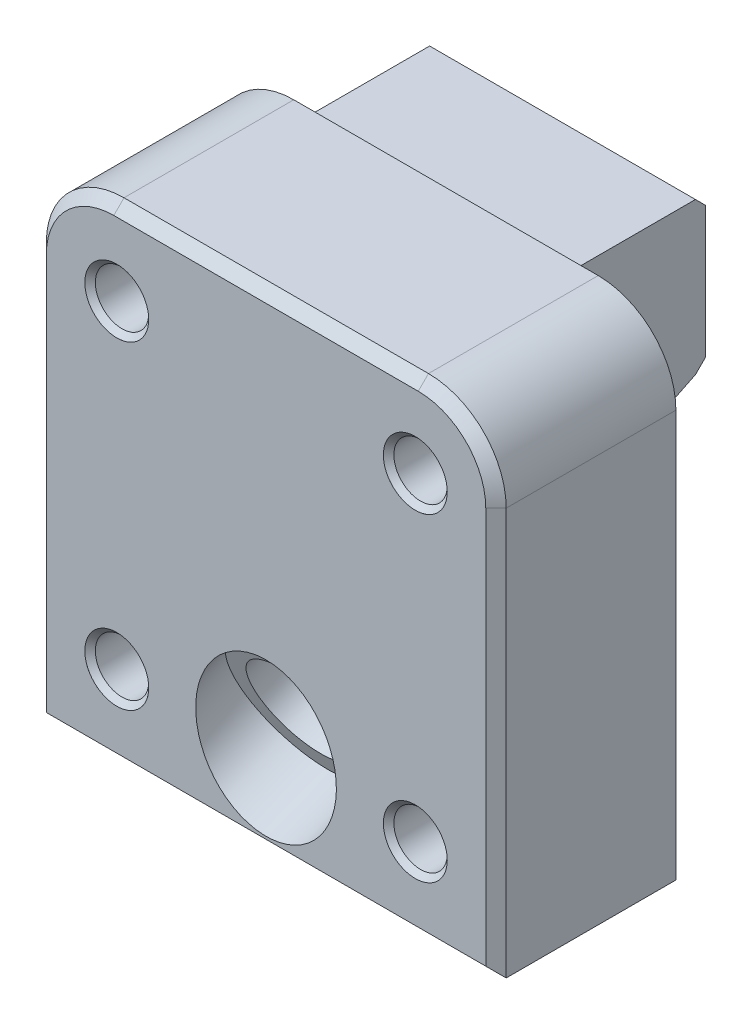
ISO-10303-21;
HEADER;
FILE_DESCRIPTION(('STEP AP214'),'2;1');
FILE_NAME('part.step','',(''),(''),'','','');
FILE_SCHEMA(('AUTOMOTIVE_DESIGN { 1 0 10303 214 1 1 1 1 }'));
ENDSEC;
DATA;
#1=APPLICATION_CONTEXT('core data for automotive mechanical design processes');
#2=APPLICATION_PROTOCOL_DEFINITION('international standard','automotive_design',2000,#1);
#3=PRODUCT_CONTEXT('',#1,'mechanical');
#4=PRODUCT('Part','Part','',(#3));
#5=PRODUCT_RELATED_PRODUCT_CATEGORY('part','',(#4));
#6=PRODUCT_DEFINITION_FORMATION('','',#4);
#7=PRODUCT_DEFINITION_CONTEXT('part definition',#1,'design');
#8=PRODUCT_DEFINITION('design','',#6,#7);
#9=PRODUCT_DEFINITION_SHAPE('','',#8);
#10=(LENGTH_UNIT() NAMED_UNIT(*) SI_UNIT(.MILLI.,.METRE.));
#11=(NAMED_UNIT(*) PLANE_ANGLE_UNIT() SI_UNIT($,.RADIAN.));
#12=(NAMED_UNIT(*) SI_UNIT($,.STERADIAN.) SOLID_ANGLE_UNIT());
#13=UNCERTAINTY_MEASURE_WITH_UNIT(LENGTH_MEASURE(1.E-05),#10,'distance_accuracy_value','');
#14=(GEOMETRIC_REPRESENTATION_CONTEXT(3) GLOBAL_UNCERTAINTY_ASSIGNED_CONTEXT((#13)) GLOBAL_UNIT_ASSIGNED_CONTEXT((#10,
#11,#12)) REPRESENTATION_CONTEXT('',''));
#15=CARTESIAN_POINT('',(0.,0.,0.));
#16=DIRECTION('',(0.,0.,1.));
#17=DIRECTION('',(1.,0.,0.));
#18=AXIS2_PLACEMENT_3D('',#15,#16,#17);
#19=CARTESIAN_POINT('',(0.,60.198,22.352));
#20=DIRECTION('',(0.,0.,-1.));
#21=DIRECTION('',(-1.,0.,0.));
#22=AXIS2_PLACEMENT_3D('',#19,#20,#21);
#23=PLANE('',#22);
#24=DIRECTION('',(0.999999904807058,-0.00043633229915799,0.));
#25=VECTOR('',#24,1.);
#26=CARTESIAN_POINT('',(22.510749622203,10.2852683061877,22.352));
#27=LINE('',#26,#25);
#28=CARTESIAN_POINT('',(22.5110036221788,10.2852681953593,22.352));
#29=VERTEX_POINT('',#28);
#30=CARTESIAN_POINT('',(22.510749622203,10.2852683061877,22.352));
#31=VERTEX_POINT('',#30);
#32=EDGE_CURVE('E379',#29,#31,#27,.F.);
#33=ORIENTED_EDGE('',*,*,#32,.F.);
#34=CARTESIAN_POINT('',(18.542,10.287,22.352));
#35=DIRECTION('',(0.,0.,1.));
#36=DIRECTION('',(1.,0.,0.));
#37=AXIS2_PLACEMENT_3D('',#34,#35,#36);
#38=CIRCLE('',#37,3.969004);
#39=CARTESIAN_POINT('',(22.511004,10.287,22.352));
#40=VERTEX_POINT('',#39);
#41=EDGE_CURVE('E330',#40,#29,#38,.T.);
#42=ORIENTED_EDGE('',*,*,#41,.F.);
#43=DIRECTION('',(1.,0.,0.));
#44=VECTOR('',#43,1.);
#45=CARTESIAN_POINT('',(22.51075,10.287,22.352));
#46=LINE('',#45,#44);
#47=CARTESIAN_POINT('',(22.51075,10.287,22.352));
#48=VERTEX_POINT('',#47);
#49=EDGE_CURVE('E43',#40,#48,#46,.F.);
#50=ORIENTED_EDGE('',*,*,#49,.T.);
#51=CARTESIAN_POINT('',(18.542,10.287,22.352));
#52=DIRECTION('',(0.,0.,-1.));
#53=DIRECTION('',(-1.,0.,0.));
#54=AXIS2_PLACEMENT_3D('',#51,#52,#53);
#55=CIRCLE('',#54,3.96875);
#56=EDGE_CURVE('E566',#48,#31,#55,.T.);
#57=ORIENTED_EDGE('',*,*,#56,.T.);
#58=EDGE_LOOP('',(#33,#42,#50,#57));
#59=FACE_BOUND('',#58,.T.);
#60=DIRECTION('',(0.999999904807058,-0.000436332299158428,0.));
#61=VECTOR('',#60,1.);
#62=CARTESIAN_POINT('',(-14.573250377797,10.2852683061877,22.352));
#63=LINE('',#62,#61);
#64=CARTESIAN_POINT('',(-14.5729963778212,10.2852681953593,22.352));
#65=VERTEX_POINT('',#64);
#66=CARTESIAN_POINT('',(-14.573250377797,10.2852683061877,22.352));
#67=VERTEX_POINT('',#66);
#68=EDGE_CURVE('E585',#65,#67,#63,.F.);
#69=ORIENTED_EDGE('',*,*,#68,.F.);
#70=CARTESIAN_POINT('',(-18.542,10.287,22.352));
#71=DIRECTION('',(0.,0.,1.));
#72=DIRECTION('',(1.,0.,0.));
#73=AXIS2_PLACEMENT_3D('',#70,#71,#72);
#74=CIRCLE('',#73,3.969004);
#75=CARTESIAN_POINT('',(-14.572996,10.287,22.352));
#76=VERTEX_POINT('',#75);
#77=EDGE_CURVE('E1463',#76,#65,#74,.T.);
#78=ORIENTED_EDGE('',*,*,#77,.F.);
#79=DIRECTION('',(1.,0.,0.));
#80=VECTOR('',#79,1.);
#81=CARTESIAN_POINT('',(-14.57325,10.287,22.352));
#82=LINE('',#81,#80);
#83=CARTESIAN_POINT('',(-14.57325,10.287,22.352));
#84=VERTEX_POINT('',#83);
#85=EDGE_CURVE('E589',#76,#84,#82,.F.);
#86=ORIENTED_EDGE('',*,*,#85,.T.);
#87=CARTESIAN_POINT('',(-18.542,10.287,22.352));
#88=DIRECTION('',(0.,0.,-1.));
#89=DIRECTION('',(-1.,0.,0.));
#90=AXIS2_PLACEMENT_3D('',#87,#88,#89);
#91=CIRCLE('',#90,3.96875);
#92=EDGE_CURVE('E386',#84,#67,#91,.T.);
#93=ORIENTED_EDGE('',*,*,#92,.T.);
#94=EDGE_LOOP('',(#69,#78,#86,#93));
#95=FACE_BOUND('',#94,.T.);
#96=DIRECTION('',(0.,-1.,0.));
#97=VECTOR('',#96,1.);
#98=CARTESIAN_POINT('',(-27.2923,0.,22.352));
#99=LINE('',#98,#97);
#100=CARTESIAN_POINT('',(-27.2923,50.546,22.352));
#101=VERTEX_POINT('',#100);
#102=CARTESIAN_POINT('',(-27.2923,1.27,22.352));
#103=VERTEX_POINT('',#102);
#104=EDGE_CURVE('E716',#101,#103,#99,.T.);
#105=ORIENTED_EDGE('',*,*,#104,.T.);
#106=DIRECTION('',(1.,0.,0.));
#107=VECTOR('',#106,1.);
#108=CARTESIAN_POINT('',(28.5623,1.27,22.352));
#109=LINE('',#108,#107);
#110=CARTESIAN_POINT('',(27.2923,1.27,22.352));
#111=VERTEX_POINT('',#110);
#112=EDGE_CURVE('E546',#103,#111,#109,.T.);
#113=ORIENTED_EDGE('',*,*,#112,.T.);
#114=DIRECTION('',(0.,1.,0.));
#115=VECTOR('',#114,1.);
#116=CARTESIAN_POINT('',(27.2923,60.198,22.352));
#117=LINE('',#116,#115);
#118=CARTESIAN_POINT('',(27.2923,50.546,22.352));
#119=VERTEX_POINT('',#118);
#120=EDGE_CURVE('E551',#111,#119,#117,.T.);
#121=ORIENTED_EDGE('',*,*,#120,.T.);
#122=CARTESIAN_POINT('',(18.9103,50.546,22.352));
#123=DIRECTION('',(0.,0.,-1.));
#124=DIRECTION('',(-1.,0.,0.));
#125=AXIS2_PLACEMENT_3D('',#122,#123,#124);
#126=CIRCLE('',#125,8.382);
#127=CARTESIAN_POINT('',(18.9103,58.928,22.352));
#128=VERTEX_POINT('',#127);
#129=EDGE_CURVE('E536',#119,#128,#126,.F.);
#130=ORIENTED_EDGE('',*,*,#129,.T.);
#131=DIRECTION('',(-1.,0.,0.));
#132=VECTOR('',#131,1.);
#133=CARTESIAN_POINT('',(0.,58.928,22.352));
#134=LINE('',#133,#132);
#135=CARTESIAN_POINT('',(-18.9103,58.928,22.352));
#136=VERTEX_POINT('',#135);
#137=EDGE_CURVE('E720',#128,#136,#134,.T.);
#138=ORIENTED_EDGE('',*,*,#137,.T.);
#139=CARTESIAN_POINT('',(-18.9103,50.546,22.352));
#140=DIRECTION('',(0.,0.,-1.));
#141=DIRECTION('',(-1.,0.,0.));
#142=AXIS2_PLACEMENT_3D('',#139,#140,#141);
#143=CIRCLE('',#142,8.382);
#144=EDGE_CURVE('E718',#136,#101,#143,.F.);
#145=ORIENTED_EDGE('',*,*,#144,.T.);
#146=EDGE_LOOP('',(#105,#113,#121,#130,#138,#145));
#147=FACE_BOUND('',#146,.T.);
#148=CARTESIAN_POINT('',(0.,11.0867451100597,22.352));
#149=DIRECTION('',(0.,0.,-1.));
#150=DIRECTION('',(0.,1.,0.));
#151=AXIS2_PLACEMENT_3D('',#148,#149,#150);
#152=ELLIPSE('',#151,9.49218243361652,8.7376);
#153=CARTESIAN_POINT('',(0.,20.5789275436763,22.352));
#154=VERTEX_POINT('',#153);
#155=EDGE_CURVE('E638',#154,#154,#152,.F.);
#156=ORIENTED_EDGE('',*,*,#155,.F.);
#157=EDGE_LOOP('',(#156));
#158=FACE_BOUND('',#157,.T.);
#159=DIRECTION('',(0.999999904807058,-0.000436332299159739,0.));
#160=VECTOR('',#159,1.);
#161=CARTESIAN_POINT('',(22.510749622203,49.9092683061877,22.352));
#162=LINE('',#161,#160);
#163=CARTESIAN_POINT('',(22.5110036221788,49.9092681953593,22.352));
#164=VERTEX_POINT('',#163);
#165=CARTESIAN_POINT('',(22.510749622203,49.9092683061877,22.352));
#166=VERTEX_POINT('',#165);
#167=EDGE_CURVE('E1452',#164,#166,#162,.F.);
#168=ORIENTED_EDGE('',*,*,#167,.F.);
#169=CARTESIAN_POINT('',(18.542,49.911,22.352));
#170=DIRECTION('',(0.,0.,1.));
#171=DIRECTION('',(1.,0.,0.));
#172=AXIS2_PLACEMENT_3D('',#169,#170,#171);
#173=CIRCLE('',#172,3.969004);
#174=CARTESIAN_POINT('',(22.511004,49.911,22.352));
#175=VERTEX_POINT('',#174);
#176=EDGE_CURVE('E1455',#175,#164,#173,.T.);
#177=ORIENTED_EDGE('',*,*,#176,.F.);
#178=DIRECTION('',(1.,0.,0.));
#179=VECTOR('',#178,1.);
#180=CARTESIAN_POINT('',(22.51075,49.911,22.352));
#181=LINE('',#180,#179);
#182=CARTESIAN_POINT('',(22.51075,49.911,22.352));
#183=VERTEX_POINT('',#182);
#184=EDGE_CURVE('E1460',#175,#183,#181,.F.);
#185=ORIENTED_EDGE('',*,*,#184,.T.);
#186=CARTESIAN_POINT('',(18.542,49.911,22.352));
#187=DIRECTION('',(0.,0.,-1.));
#188=DIRECTION('',(-1.,0.,0.));
#189=AXIS2_PLACEMENT_3D('',#186,#187,#188);
#190=CIRCLE('',#189,3.96875);
#191=EDGE_CURVE('E385',#183,#166,#190,.T.);
#192=ORIENTED_EDGE('',*,*,#191,.T.);
#193=EDGE_LOOP('',(#168,#177,#185,#192));
#194=FACE_BOUND('',#193,.T.);
#195=DIRECTION('',(0.999999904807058,-0.000436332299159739,0.));
#196=VECTOR('',#195,1.);
#197=CARTESIAN_POINT('',(-14.573250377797,49.9092683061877,22.352));
#198=LINE('',#197,#196);
#199=CARTESIAN_POINT('',(-14.5729963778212,49.9092681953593,22.352));
#200=VERTEX_POINT('',#199);
#201=CARTESIAN_POINT('',(-14.573250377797,49.9092683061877,22.352));
#202=VERTEX_POINT('',#201);
#203=EDGE_CURVE('E352',#200,#202,#198,.F.);
#204=ORIENTED_EDGE('',*,*,#203,.F.);
#205=CARTESIAN_POINT('',(-18.542,49.911,22.352));
#206=DIRECTION('',(0.,0.,1.));
#207=DIRECTION('',(1.,0.,0.));
#208=AXIS2_PLACEMENT_3D('',#205,#206,#207);
#209=CIRCLE('',#208,3.969004);
#210=CARTESIAN_POINT('',(-14.572996,49.911,22.352));
#211=VERTEX_POINT('',#210);
#212=EDGE_CURVE('E414',#211,#200,#209,.T.);
#213=ORIENTED_EDGE('',*,*,#212,.F.);
#214=DIRECTION('',(1.,0.,0.));
#215=VECTOR('',#214,1.);
#216=CARTESIAN_POINT('',(-14.57325,49.911,22.352));
#217=LINE('',#216,#215);
#218=CARTESIAN_POINT('',(-14.57325,49.911,22.352));
#219=VERTEX_POINT('',#218);
#220=EDGE_CURVE('E22',#211,#219,#217,.F.);
#221=ORIENTED_EDGE('',*,*,#220,.T.);
#222=CARTESIAN_POINT('',(-18.542,49.911,22.352));
#223=DIRECTION('',(0.,0.,-1.));
#224=DIRECTION('',(-1.,0.,0.));
#225=AXIS2_PLACEMENT_3D('',#222,#223,#224);
#226=CIRCLE('',#225,3.96875);
#227=EDGE_CURVE('E382',#219,#202,#226,.T.);
#228=ORIENTED_EDGE('',*,*,#227,.T.);
#229=EDGE_LOOP('',(#204,#213,#221,#228));
#230=FACE_BOUND('',#229,.T.);
#231=ADVANCED_FACE('F18',(#59,#95,#147,#158,#194,#230),#23,.F.);
#232=CARTESIAN_POINT('',(-16.51,60.198,0.));
#233=DIRECTION('',(-1.,0.,0.));
#234=DIRECTION('',(0.,0.,1.));
#235=AXIS2_PLACEMENT_3D('',#232,#233,#234);
#236=PLANE('',#235);
#237=DIRECTION('',(0.,-1.,0.));
#238=VECTOR('',#237,1.);
#239=CARTESIAN_POINT('',(-16.51,60.198,-15.748));
#240=LINE('',#239,#238);
#241=CARTESIAN_POINT('',(-16.51,58.674,-15.748));
#242=VERTEX_POINT('',#241);
#243=CARTESIAN_POINT('',(-16.51,42.3654504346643,-15.748));
#244=VERTEX_POINT('',#243);
#245=EDGE_CURVE('E652',#242,#244,#240,.T.);
#246=ORIENTED_EDGE('',*,*,#245,.T.);
#247=DIRECTION('',(0.,0.707106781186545,-0.70710678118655));
#248=VECTOR('',#247,1.);
#249=CARTESIAN_POINT('',(-16.51,43.4077252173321,-16.7902747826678));
#250=LINE('',#249,#248);
#251=CARTESIAN_POINT('',(-16.51,41.101071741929,-14.4836213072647));
#252=VERTEX_POINT('',#251);
#253=EDGE_CURVE('E707',#244,#252,#250,.F.);
#254=ORIENTED_EDGE('',*,*,#253,.T.);
#255=DIRECTION('',(0.,0.438371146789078,-0.898794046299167));
#256=VECTOR('',#255,1.);
#257=CARTESIAN_POINT('',(-16.51,39.0642896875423,-10.307599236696));
#258=LINE('',#257,#256);
#259=CARTESIAN_POINT('',(-16.51,34.7327063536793,-1.42653728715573));
#260=VERTEX_POINT('',#259);
#261=EDGE_CURVE('E637',#260,#252,#258,.T.);
#262=ORIENTED_EDGE('',*,*,#261,.F.);
#263=CARTESIAN_POINT('',(-16.51,32.4497694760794,-2.54));
#264=DIRECTION('',(-1.,0.,0.));
#265=DIRECTION('',(0.,0.,1.));
#266=AXIS2_PLACEMENT_3D('',#263,#264,#265);
#267=CIRCLE('',#266,2.54);
#268=CARTESIAN_POINT('',(-16.51,32.4497694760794,0.));
#269=VERTEX_POINT('',#268);
#270=EDGE_CURVE('E690',#260,#269,#267,.F.);
#271=ORIENTED_EDGE('',*,*,#270,.T.);
#272=DIRECTION('',(0.,-1.,0.));
#273=VECTOR('',#272,1.);
#274=CARTESIAN_POINT('',(-16.51,60.198,0.));
#275=LINE('',#274,#273);
#276=CARTESIAN_POINT('',(-16.51,59.944,0.));
#277=VERTEX_POINT('',#276);
#278=EDGE_CURVE('E649',#277,#269,#275,.T.);
#279=ORIENTED_EDGE('',*,*,#278,.F.);
#280=DIRECTION('',(0.,0.,1.));
#281=VECTOR('',#280,1.);
#282=CARTESIAN_POINT('',(-16.51,59.944,-15.748));
#283=LINE('',#282,#281);
#284=CARTESIAN_POINT('',(-16.51,59.944,-14.478));
#285=VERTEX_POINT('',#284);
#286=EDGE_CURVE('E630',#285,#277,#283,.T.);
#287=ORIENTED_EDGE('',*,*,#286,.F.);
#288=DIRECTION('',(0.,-0.707106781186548,-0.707106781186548));
#289=VECTOR('',#288,1.);
#290=CARTESIAN_POINT('',(-16.51,67.31,-7.112));
#291=LINE('',#290,#289);
#292=EDGE_CURVE('E698',#285,#242,#291,.T.);
#293=ORIENTED_EDGE('',*,*,#292,.T.);
#294=EDGE_LOOP('',(#246,#254,#262,#271,#279,#287,#293));
#295=FACE_BOUND('',#294,.T.);
#296=ADVANCED_FACE('F451',(#295),#236,.T.);
#297=CARTESIAN_POINT('',(16.51,60.198,0.));
#298=DIRECTION('',(-1.,0.,0.));
#299=DIRECTION('',(0.,0.,1.));
#300=AXIS2_PLACEMENT_3D('',#297,#298,#299);
#301=PLANE('',#300);
#302=DIRECTION('',(0.,0.438371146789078,-0.898794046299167));
#303=VECTOR('',#302,1.);
#304=CARTESIAN_POINT('',(16.51,39.0642896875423,-10.307599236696));
#305=LINE('',#304,#303);
#306=CARTESIAN_POINT('',(16.51,34.7327063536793,-1.42653728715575));
#307=VERTEX_POINT('',#306);
#308=CARTESIAN_POINT('',(16.51,41.101071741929,-14.4836213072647));
#309=VERTEX_POINT('',#308);
#310=EDGE_CURVE('E634',#307,#309,#305,.T.);
#311=ORIENTED_EDGE('',*,*,#310,.T.);
#312=DIRECTION('',(0.,-0.707106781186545,0.70710678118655));
#313=VECTOR('',#312,1.);
#314=CARTESIAN_POINT('',(16.51,42.3654504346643,-15.748));
#315=LINE('',#314,#313);
#316=CARTESIAN_POINT('',(16.51,42.3654504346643,-15.748));
#317=VERTEX_POINT('',#316);
#318=EDGE_CURVE('E711',#309,#317,#315,.F.);
#319=ORIENTED_EDGE('',*,*,#318,.T.);
#320=DIRECTION('',(0.,-1.,0.));
#321=VECTOR('',#320,1.);
#322=CARTESIAN_POINT('',(16.51,60.198,-15.748));
#323=LINE('',#322,#321);
#324=CARTESIAN_POINT('',(16.51,58.674,-15.748));
#325=VERTEX_POINT('',#324);
#326=EDGE_CURVE('E655',#325,#317,#323,.T.);
#327=ORIENTED_EDGE('',*,*,#326,.F.);
#328=DIRECTION('',(0.,0.707106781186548,0.707106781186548));
#329=VECTOR('',#328,1.);
#330=CARTESIAN_POINT('',(16.51,59.944,-14.478));
#331=LINE('',#330,#329);
#332=CARTESIAN_POINT('',(16.51,59.944,-14.478));
#333=VERTEX_POINT('',#332);
#334=EDGE_CURVE('E702',#325,#333,#331,.T.);
#335=ORIENTED_EDGE('',*,*,#334,.T.);
#336=DIRECTION('',(0.,0.,1.));
#337=VECTOR('',#336,1.);
#338=CARTESIAN_POINT('',(16.51,59.944,-15.748));
#339=LINE('',#338,#337);
#340=CARTESIAN_POINT('',(16.51,59.944,0.));
#341=VERTEX_POINT('',#340);
#342=EDGE_CURVE('E629',#333,#341,#339,.T.);
#343=ORIENTED_EDGE('',*,*,#342,.T.);
#344=DIRECTION('',(0.,-1.,0.));
#345=VECTOR('',#344,1.);
#346=CARTESIAN_POINT('',(16.51,60.198,0.));
#347=LINE('',#346,#345);
#348=CARTESIAN_POINT('',(16.51,32.4497694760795,0.));
#349=VERTEX_POINT('',#348);
#350=EDGE_CURVE('E658',#341,#349,#347,.T.);
#351=ORIENTED_EDGE('',*,*,#350,.T.);
#352=CARTESIAN_POINT('',(16.51,32.4497694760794,-2.54));
#353=DIRECTION('',(-1.,0.,0.));
#354=DIRECTION('',(0.,0.,1.));
#355=AXIS2_PLACEMENT_3D('',#352,#353,#354);
#356=CIRCLE('',#355,2.54);
#357=EDGE_CURVE('E693',#349,#307,#356,.T.);
#358=ORIENTED_EDGE('',*,*,#357,.T.);
#359=EDGE_LOOP('',(#311,#319,#327,#335,#343,#351,#358));
#360=FACE_BOUND('',#359,.T.);
#361=ADVANCED_FACE('F457',(#360),#301,.F.);
#362=CARTESIAN_POINT('',(16.51,60.198,-15.748));
#363=DIRECTION('',(0.,0.,1.));
#364=DIRECTION('',(1.,0.,0.));
#365=AXIS2_PLACEMENT_3D('',#362,#363,#364);
#366=PLANE('',#365);
#367=ORIENTED_EDGE('',*,*,#326,.T.);
#368=DIRECTION('',(-1.,0.,0.));
#369=VECTOR('',#368,1.);
#370=CARTESIAN_POINT('',(16.51,42.3654504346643,-15.748));
#371=LINE('',#370,#369);
#372=EDGE_CURVE('E704',#317,#244,#371,.T.);
#373=ORIENTED_EDGE('',*,*,#372,.T.);
#374=ORIENTED_EDGE('',*,*,#245,.F.);
#375=DIRECTION('',(1.,0.,0.));
#376=VECTOR('',#375,1.);
#377=CARTESIAN_POINT('',(16.51,58.674,-15.748));
#378=LINE('',#377,#376);
#379=EDGE_CURVE('E700',#242,#325,#378,.T.);
#380=ORIENTED_EDGE('',*,*,#379,.T.);
#381=EDGE_LOOP('',(#367,#373,#374,#380));
#382=FACE_BOUND('',#381,.T.);
#383=ADVANCED_FACE('F474',(#382),#366,.F.);
#384=CARTESIAN_POINT('',(-16.51,60.198,22.352));
#385=DIRECTION('',(0.,-1.,0.));
#386=DIRECTION('',(0.,0.,-1.));
#387=AXIS2_PLACEMENT_3D('',#384,#385,#386);
#388=PLANE('',#387);
#389=DIRECTION('',(0.,0.,1.));
#390=VECTOR('',#389,1.);
#391=CARTESIAN_POINT('',(-18.9103,60.198,22.352));
#392=LINE('',#391,#390);
#393=CARTESIAN_POINT('',(-18.9103,60.198,0.));
#394=VERTEX_POINT('',#393);
#395=CARTESIAN_POINT('',(-18.9103,60.198,21.082));
#396=VERTEX_POINT('',#395);
#397=EDGE_CURVE('E677',#394,#396,#392,.T.);
#398=ORIENTED_EDGE('',*,*,#397,.T.);
#399=DIRECTION('',(1.,0.,0.));
#400=VECTOR('',#399,1.);
#401=CARTESIAN_POINT('',(-16.51,60.198,21.082));
#402=LINE('',#401,#400);
#403=CARTESIAN_POINT('',(18.9103,60.198,21.082));
#404=VERTEX_POINT('',#403);
#405=EDGE_CURVE('E548',#396,#404,#402,.T.);
#406=ORIENTED_EDGE('',*,*,#405,.T.);
#407=DIRECTION('',(0.,0.,1.));
#408=VECTOR('',#407,1.);
#409=CARTESIAN_POINT('',(18.9103,60.198,22.352));
#410=LINE('',#409,#408);
#411=CARTESIAN_POINT('',(18.9103,60.198,0.));
#412=VERTEX_POINT('',#411);
#413=EDGE_CURVE('E669',#404,#412,#410,.F.);
#414=ORIENTED_EDGE('',*,*,#413,.T.);
#415=DIRECTION('',(-1.,0.,0.));
#416=VECTOR('',#415,1.);
#417=CARTESIAN_POINT('',(28.5623,60.198,0.));
#418=LINE('',#417,#416);
#419=EDGE_CURVE('E646',#412,#394,#418,.T.);
#420=ORIENTED_EDGE('',*,*,#419,.T.);
#421=EDGE_LOOP('',(#398,#406,#414,#420));
#422=FACE_BOUND('',#421,.T.);
#423=ADVANCED_FACE('F464',(#422),#388,.F.);
#424=CARTESIAN_POINT('',(-16.51,0.,22.352));
#425=DIRECTION('',(0.,-1.,0.));
#426=DIRECTION('',(0.,0.,-1.));
#427=AXIS2_PLACEMENT_3D('',#424,#425,#426);
#428=PLANE('',#427);
#429=DIRECTION('',(0.,0.,-1.));
#430=VECTOR('',#429,1.);
#431=CARTESIAN_POINT('',(28.5623,0.,22.352));
#432=LINE('',#431,#430);
#433=CARTESIAN_POINT('',(28.5623,0.,21.082));
#434=VERTEX_POINT('',#433);
#435=CARTESIAN_POINT('',(28.5623,0.,0.));
#436=VERTEX_POINT('',#435);
#437=EDGE_CURVE('E645',#434,#436,#432,.T.);
#438=ORIENTED_EDGE('',*,*,#437,.F.);
#439=DIRECTION('',(-1.,0.,0.));
#440=VECTOR('',#439,1.);
#441=CARTESIAN_POINT('',(-28.5623,0.,21.082));
#442=LINE('',#441,#440);
#443=CARTESIAN_POINT('',(-28.5623,0.,21.082));
#444=VERTEX_POINT('',#443);
#445=EDGE_CURVE('E713',#434,#444,#442,.T.);
#446=ORIENTED_EDGE('',*,*,#445,.T.);
#447=DIRECTION('',(0.,0.,-1.));
#448=VECTOR('',#447,1.);
#449=CARTESIAN_POINT('',(-28.5623,0.,22.352));
#450=LINE('',#449,#448);
#451=CARTESIAN_POINT('',(-28.5623,0.,0.));
#452=VERTEX_POINT('',#451);
#453=EDGE_CURVE('E641',#444,#452,#450,.T.);
#454=ORIENTED_EDGE('',*,*,#453,.T.);
#455=DIRECTION('',(-1.,0.,0.));
#456=VECTOR('',#455,1.);
#457=CARTESIAN_POINT('',(28.5623,0.,0.));
#458=LINE('',#457,#456);
#459=EDGE_CURVE('E642',#436,#452,#458,.T.);
#460=ORIENTED_EDGE('',*,*,#459,.F.);
#461=EDGE_LOOP('',(#438,#446,#454,#460));
#462=FACE_BOUND('',#461,.T.);
#463=ADVANCED_FACE('F503',(#462),#428,.T.);
#464=CARTESIAN_POINT('',(-28.5623,60.198,22.352));
#465=DIRECTION('',(-1.,0.,0.));
#466=DIRECTION('',(0.,0.,1.));
#467=AXIS2_PLACEMENT_3D('',#464,#465,#466);
#468=PLANE('',#467);
#469=ORIENTED_EDGE('',*,*,#453,.F.);
#470=DIRECTION('',(0.,1.,0.));
#471=VECTOR('',#470,1.);
#472=CARTESIAN_POINT('',(-28.5623,50.546,21.082));
#473=LINE('',#472,#471);
#474=CARTESIAN_POINT('',(-28.5623,50.546,21.082));
#475=VERTEX_POINT('',#474);
#476=EDGE_CURVE('E558',#444,#475,#473,.T.);
#477=ORIENTED_EDGE('',*,*,#476,.T.);
#478=DIRECTION('',(0.,0.,1.));
#479=VECTOR('',#478,1.);
#480=CARTESIAN_POINT('',(-28.5623,50.546,0.));
#481=LINE('',#480,#479);
#482=CARTESIAN_POINT('',(-28.5623,50.546,0.));
#483=VERTEX_POINT('',#482);
#484=EDGE_CURVE('E680',#475,#483,#481,.F.);
#485=ORIENTED_EDGE('',*,*,#484,.T.);
#486=DIRECTION('',(0.,-1.,0.));
#487=VECTOR('',#486,1.);
#488=CARTESIAN_POINT('',(-28.5623,60.198,0.));
#489=LINE('',#488,#487);
#490=EDGE_CURVE('E651',#483,#452,#489,.T.);
#491=ORIENTED_EDGE('',*,*,#490,.T.);
#492=EDGE_LOOP('',(#469,#477,#485,#491));
#493=FACE_BOUND('',#492,.T.);
#494=ADVANCED_FACE('F470',(#493),#468,.T.);
#495=CARTESIAN_POINT('',(28.5623,60.198,0.));
#496=DIRECTION('',(0.,0.,1.));
#497=DIRECTION('',(1.,0.,0.));
#498=AXIS2_PLACEMENT_3D('',#495,#496,#497);
#499=PLANE('',#498);
#500=ORIENTED_EDGE('',*,*,#278,.T.);
#501=DIRECTION('',(-1.,0.,0.));
#502=VECTOR('',#501,1.);
#503=CARTESIAN_POINT('',(16.51,32.4497694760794,0.));
#504=LINE('',#503,#502);
#505=EDGE_CURVE('E687',#269,#349,#504,.F.);
#506=ORIENTED_EDGE('',*,*,#505,.T.);
#507=ORIENTED_EDGE('',*,*,#350,.F.);
#508=DIRECTION('',(1.,0.,0.));
#509=VECTOR('',#508,1.);
#510=CARTESIAN_POINT('',(16.51,59.944,0.));
#511=LINE('',#510,#509);
#512=EDGE_CURVE('E626',#341,#277,#511,.F.);
#513=ORIENTED_EDGE('',*,*,#512,.T.);
#514=EDGE_LOOP('',(#500,#506,#507,#513));
#515=FACE_BOUND('',#514,.T.);
#516=CARTESIAN_POINT('',(0.,20.5746062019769,0.));
#517=DIRECTION('',(0.,0.,1.));
#518=DIRECTION('',(0.,-1.,0.));
#519=AXIS2_PLACEMENT_3D('',#516,#517,#518);
#520=ELLIPSE('',#519,6.90528678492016,6.35635);
#521=CARTESIAN_POINT('',(0.,13.6693194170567,0.));
#522=VERTEX_POINT('',#521);
#523=EDGE_CURVE('E665',#522,#522,#520,.T.);
#524=ORIENTED_EDGE('',*,*,#523,.T.);
#525=EDGE_LOOP('',(#524));
#526=FACE_BOUND('',#525,.T.);
#527=ORIENTED_EDGE('',*,*,#490,.F.);
#528=CARTESIAN_POINT('',(-18.9103,50.546,0.));
#529=DIRECTION('',(0.,0.,1.));
#530=DIRECTION('',(1.,0.,0.));
#531=AXIS2_PLACEMENT_3D('',#528,#529,#530);
#532=CIRCLE('',#531,9.652);
#533=EDGE_CURVE('E526',#483,#394,#532,.F.);
#534=ORIENTED_EDGE('',*,*,#533,.T.);
#535=ORIENTED_EDGE('',*,*,#419,.F.);
#536=CARTESIAN_POINT('',(18.9103,50.546,0.));
#537=DIRECTION('',(0.,0.,1.));
#538=DIRECTION('',(1.,0.,0.));
#539=AXIS2_PLACEMENT_3D('',#536,#537,#538);
#540=CIRCLE('',#539,9.652);
#541=CARTESIAN_POINT('',(28.5623,50.546,0.));
#542=VERTEX_POINT('',#541);
#543=EDGE_CURVE('E682',#412,#542,#540,.F.);
#544=ORIENTED_EDGE('',*,*,#543,.T.);
#545=DIRECTION('',(0.,-1.,0.));
#546=VECTOR('',#545,1.);
#547=CARTESIAN_POINT('',(28.5623,60.198,0.));
#548=LINE('',#547,#546);
#549=EDGE_CURVE('E522',#542,#436,#548,.T.);
#550=ORIENTED_EDGE('',*,*,#549,.T.);
#551=ORIENTED_EDGE('',*,*,#459,.T.);
#552=EDGE_LOOP('',(#527,#534,#535,#544,#550,#551));
#553=FACE_BOUND('',#552,.T.);
#554=ADVANCED_FACE('F466',(#515,#526,#553),#499,.F.);
#555=CARTESIAN_POINT('',(28.5623,60.198,22.352));
#556=DIRECTION('',(-1.,0.,0.));
#557=DIRECTION('',(0.,0.,1.));
#558=AXIS2_PLACEMENT_3D('',#555,#556,#557);
#559=PLANE('',#558);
#560=DIRECTION('',(0.,0.,1.));
#561=VECTOR('',#560,1.);
#562=CARTESIAN_POINT('',(28.5623,50.546,22.352));
#563=LINE('',#562,#561);
#564=CARTESIAN_POINT('',(28.5623,50.546,21.082));
#565=VERTEX_POINT('',#564);
#566=EDGE_CURVE('E516',#542,#565,#563,.T.);
#567=ORIENTED_EDGE('',*,*,#566,.T.);
#568=DIRECTION('',(0.,-1.,0.));
#569=VECTOR('',#568,1.);
#570=CARTESIAN_POINT('',(28.5623,60.198,21.082));
#571=LINE('',#570,#569);
#572=EDGE_CURVE('E519',#565,#434,#571,.T.);
#573=ORIENTED_EDGE('',*,*,#572,.T.);
#574=ORIENTED_EDGE('',*,*,#437,.T.);
#575=ORIENTED_EDGE('',*,*,#549,.F.);
#576=EDGE_LOOP('',(#567,#573,#574,#575));
#577=FACE_BOUND('',#576,.T.);
#578=ADVANCED_FACE('F469',(#577),#559,.F.);
#579=CARTESIAN_POINT('',(168.074859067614,34.0369376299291,0.));
#580=DIRECTION('',(0.,0.898794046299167,0.438371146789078));
#581=DIRECTION('',(0.,-0.438371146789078,0.898794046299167));
#582=AXIS2_PLACEMENT_3D('',#579,#580,#581);
#583=PLANE('',#582);
#584=ORIENTED_EDGE('',*,*,#261,.T.);
#585=DIRECTION('',(1.,0.,0.));
#586=VECTOR('',#585,1.);
#587=CARTESIAN_POINT('',(168.074859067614,41.101071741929,-14.4836213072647));
#588=LINE('',#587,#586);
#589=EDGE_CURVE('E709',#252,#309,#588,.T.);
#590=ORIENTED_EDGE('',*,*,#589,.T.);
#591=ORIENTED_EDGE('',*,*,#310,.F.);
#592=DIRECTION('',(-1.,0.,0.));
#593=VECTOR('',#592,1.);
#594=CARTESIAN_POINT('',(-16.51,34.7327063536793,-1.42653728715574));
#595=LINE('',#594,#593);
#596=EDGE_CURVE('E525',#307,#260,#595,.T.);
#597=ORIENTED_EDGE('',*,*,#596,.T.);
#598=EDGE_LOOP('',(#584,#590,#591,#597));
#599=FACE_BOUND('',#598,.T.);
#600=ADVANCED_FACE('F506',(#599),#583,.F.);
#601=CARTESIAN_POINT('',(0.,2.47865266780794,42.6313949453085));
#602=DIRECTION('',(0.,0.390731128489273,-0.92050485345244));
#603=DIRECTION('',(0.,0.92050485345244,0.390731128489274));
#604=AXIS2_PLACEMENT_3D('',#601,#602,#603);
#605=CYLINDRICAL_SURFACE('',#604,8.7376);
#606=CARTESIAN_POINT('',(0.,12.9236380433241,18.0245514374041));
#607=DIRECTION('',(0.,-0.390731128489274,0.920504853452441));
#608=DIRECTION('',(0.,-0.92050485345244,-0.390731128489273));
#609=AXIS2_PLACEMENT_3D('',#606,#607,#608);
#610=CIRCLE('',#609,8.7376);
#611=CARTESIAN_POINT('',(0.,4.88063483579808,14.6104991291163));
#612=VERTEX_POINT('',#611);
#613=EDGE_CURVE('E662',#612,#612,#610,.T.);
#614=ORIENTED_EDGE('',*,*,#613,.F.);
#615=EDGE_LOOP('',(#614));
#616=FACE_BOUND('',#615,.T.);
#617=ORIENTED_EDGE('',*,*,#155,.T.);
#618=EDGE_LOOP('',(#617));
#619=FACE_BOUND('',#618,.T.);
#620=ADVANCED_FACE('F482',(#616,#619),#605,.F.);
#621=CARTESIAN_POINT('',(0.,12.9236380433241,18.0245514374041));
#622=DIRECTION('',(0.,-0.390731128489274,0.920504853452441));
#623=DIRECTION('',(0.,-0.92050485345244,-0.390731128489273));
#624=AXIS2_PLACEMENT_3D('',#621,#622,#623);
#625=PLANE('',#624);
#626=CARTESIAN_POINT('',(0.,12.9236380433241,18.0245514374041));
#627=DIRECTION('',(0.,-0.390731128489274,0.920504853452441));
#628=DIRECTION('',(0.,-0.92050485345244,-0.390731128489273));
#629=AXIS2_PLACEMENT_3D('',#626,#627,#628);
#630=CIRCLE('',#629,6.35635);
#631=CARTESIAN_POINT('',(0.,7.07258701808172,15.5409276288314));
#632=VERTEX_POINT('',#631);
#633=EDGE_CURVE('E632',#632,#632,#630,.T.);
#634=ORIENTED_EDGE('',*,*,#633,.F.);
#635=EDGE_LOOP('',(#634));
#636=FACE_BOUND('',#635,.T.);
#637=ORIENTED_EDGE('',*,*,#613,.T.);
#638=EDGE_LOOP('',(#637));
#639=FACE_BOUND('',#638,.T.);
#640=ADVANCED_FACE('F479',(#636,#639),#625,.T.);
#641=CARTESIAN_POINT('',(0.,22.3277939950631,-4.1302516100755));
#642=DIRECTION('',(0.,-0.390731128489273,0.92050485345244));
#643=DIRECTION('',(0.,-0.92050485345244,-0.390731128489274));
#644=AXIS2_PLACEMENT_3D('',#641,#642,#643);
#645=CYLINDRICAL_SURFACE('',#644,6.35635);
#646=ORIENTED_EDGE('',*,*,#633,.T.);
#647=EDGE_LOOP('',(#646));
#648=FACE_BOUND('',#647,.T.);
#649=ORIENTED_EDGE('',*,*,#523,.F.);
#650=EDGE_LOOP('',(#649));
#651=FACE_BOUND('',#650,.T.);
#652=ADVANCED_FACE('F20',(#648,#651),#645,.F.);
#653=CARTESIAN_POINT('',(16.51,59.944,-15.748));
#654=DIRECTION('',(0.,1.,0.));
#655=DIRECTION('',(0.,0.,1.));
#656=AXIS2_PLACEMENT_3D('',#653,#654,#655);
#657=PLANE('',#656);
#658=ORIENTED_EDGE('',*,*,#342,.F.);
#659=DIRECTION('',(-1.,0.,0.));
#660=VECTOR('',#659,1.);
#661=CARTESIAN_POINT('',(-16.51,59.944,-14.478));
#662=LINE('',#661,#660);
#663=EDGE_CURVE('E695',#333,#285,#662,.T.);
#664=ORIENTED_EDGE('',*,*,#663,.T.);
#665=ORIENTED_EDGE('',*,*,#286,.T.);
#666=ORIENTED_EDGE('',*,*,#512,.F.);
#667=EDGE_LOOP('',(#658,#664,#665,#666));
#668=FACE_BOUND('',#667,.T.);
#669=ADVANCED_FACE('F497',(#668),#657,.T.);
#670=CARTESIAN_POINT('',(18.542,10.287,7.112));
#671=DIRECTION('',(0.,0.,1.));
#672=DIRECTION('',(1.,0.,0.));
#673=AXIS2_PLACEMENT_3D('',#670,#671,#672);
#674=CYLINDRICAL_SURFACE('',#673,3.3147);
#675=CARTESIAN_POINT('',(18.542,10.287,21.69795));
#676=DIRECTION('',(0.,0.,-1.));
#677=DIRECTION('',(-1.,0.,0.));
#678=AXIS2_PLACEMENT_3D('',#675,#676,#677);
#679=CIRCLE('',#678,3.3147);
#680=CARTESIAN_POINT('',(15.2273,10.287,21.69795));
#681=VERTEX_POINT('',#680);
#682=EDGE_CURVE('E560',#681,#681,#679,.F.);
#683=ORIENTED_EDGE('',*,*,#682,.T.);
#684=EDGE_LOOP('',(#683));
#685=FACE_BOUND('',#684,.T.);
#686=CARTESIAN_POINT('',(18.542,10.287,5.207));
#687=DIRECTION('',(0.,0.,-1.));
#688=DIRECTION('',(-1.,0.,0.));
#689=AXIS2_PLACEMENT_3D('',#686,#687,#688);
#690=CIRCLE('',#689,3.3147);
#691=CARTESIAN_POINT('',(15.2273,10.287,5.207));
#692=VERTEX_POINT('',#691);
#693=EDGE_CURVE('E588',#692,#692,#690,.T.);
#694=ORIENTED_EDGE('',*,*,#693,.T.);
#695=EDGE_LOOP('',(#694));
#696=FACE_BOUND('',#695,.T.);
#697=ADVANCED_FACE('F493',(#685,#696),#674,.F.);
#698=CARTESIAN_POINT('',(-18.542,49.911,7.112));
#699=DIRECTION('',(0.,0.,1.));
#700=DIRECTION('',(1.,0.,0.));
#701=AXIS2_PLACEMENT_3D('',#698,#699,#700);
#702=CYLINDRICAL_SURFACE('',#701,3.3147);
#703=CARTESIAN_POINT('',(-18.542,49.911,21.69795));
#704=DIRECTION('',(0.,0.,-1.));
#705=DIRECTION('',(-1.,0.,0.));
#706=AXIS2_PLACEMENT_3D('',#703,#704,#705);
#707=CIRCLE('',#706,3.3147);
#708=CARTESIAN_POINT('',(-21.8567,49.911,21.69795));
#709=VERTEX_POINT('',#708);
#710=EDGE_CURVE('E28',#709,#709,#707,.F.);
#711=ORIENTED_EDGE('',*,*,#710,.T.);
#712=EDGE_LOOP('',(#711));
#713=FACE_BOUND('',#712,.T.);
#714=CARTESIAN_POINT('',(-18.542,49.911,5.207));
#715=DIRECTION('',(0.,0.,-1.));
#716=DIRECTION('',(-1.,0.,0.));
#717=AXIS2_PLACEMENT_3D('',#714,#715,#716);
#718=CIRCLE('',#717,3.3147);
#719=CARTESIAN_POINT('',(-21.8567,49.911,5.207));
#720=VERTEX_POINT('',#719);
#721=EDGE_CURVE('E611',#720,#720,#718,.T.);
#722=ORIENTED_EDGE('',*,*,#721,.T.);
#723=EDGE_LOOP('',(#722));
#724=FACE_BOUND('',#723,.T.);
#725=ADVANCED_FACE('F490',(#713,#724),#702,.F.);
#726=CARTESIAN_POINT('',(18.542,49.911,7.112));
#727=DIRECTION('',(0.,0.,1.));
#728=DIRECTION('',(1.,0.,0.));
#729=AXIS2_PLACEMENT_3D('',#726,#727,#728);
#730=CYLINDRICAL_SURFACE('',#729,3.3147);
#731=CARTESIAN_POINT('',(18.542,49.911,21.69795));
#732=DIRECTION('',(0.,0.,-1.));
#733=DIRECTION('',(-1.,0.,0.));
#734=AXIS2_PLACEMENT_3D('',#731,#732,#733);
#735=CIRCLE('',#734,3.3147);
#736=CARTESIAN_POINT('',(15.2273,49.911,21.69795));
#737=VERTEX_POINT('',#736);
#738=EDGE_CURVE('E563',#737,#737,#735,.F.);
#739=ORIENTED_EDGE('',*,*,#738,.T.);
#740=EDGE_LOOP('',(#739));
#741=FACE_BOUND('',#740,.T.);
#742=CARTESIAN_POINT('',(18.542,49.911,5.207));
#743=DIRECTION('',(0.,0.,-1.));
#744=DIRECTION('',(-1.,0.,0.));
#745=AXIS2_PLACEMENT_3D('',#742,#743,#744);
#746=CIRCLE('',#745,3.3147);
#747=CARTESIAN_POINT('',(15.2273,49.911,5.207));
#748=VERTEX_POINT('',#747);
#749=EDGE_CURVE('E608',#748,#748,#746,.T.);
#750=ORIENTED_EDGE('',*,*,#749,.T.);
#751=EDGE_LOOP('',(#750));
#752=FACE_BOUND('',#751,.T.);
#753=ADVANCED_FACE('F488',(#741,#752),#730,.F.);
#754=CARTESIAN_POINT('',(-18.542,10.287,7.112));
#755=DIRECTION('',(0.,0.,1.));
#756=DIRECTION('',(1.,0.,0.));
#757=AXIS2_PLACEMENT_3D('',#754,#755,#756);
#758=CYLINDRICAL_SURFACE('',#757,3.3147);
#759=CARTESIAN_POINT('',(-18.542,10.287,21.69795));
#760=DIRECTION('',(0.,0.,-1.));
#761=DIRECTION('',(-1.,0.,0.));
#762=AXIS2_PLACEMENT_3D('',#759,#760,#761);
#763=CIRCLE('',#762,3.3147);
#764=CARTESIAN_POINT('',(-21.8567,10.287,21.69795));
#765=VERTEX_POINT('',#764);
#766=EDGE_CURVE('E11',#765,#765,#763,.F.);
#767=ORIENTED_EDGE('',*,*,#766,.T.);
#768=EDGE_LOOP('',(#767));
#769=FACE_BOUND('',#768,.T.);
#770=CARTESIAN_POINT('',(-18.542,10.287,5.207));
#771=DIRECTION('',(0.,0.,-1.));
#772=DIRECTION('',(-1.,0.,0.));
#773=AXIS2_PLACEMENT_3D('',#770,#771,#772);
#774=CIRCLE('',#773,3.3147);
#775=CARTESIAN_POINT('',(-21.8567,10.287,5.207));
#776=VERTEX_POINT('',#775);
#777=EDGE_CURVE('E614',#776,#776,#774,.T.);
#778=ORIENTED_EDGE('',*,*,#777,.T.);
#779=EDGE_LOOP('',(#778));
#780=FACE_BOUND('',#779,.T.);
#781=ADVANCED_FACE('F484',(#769,#780),#758,.F.);
#782=CARTESIAN_POINT('',(-18.9103,50.546,22.352));
#783=DIRECTION('',(0.,0.,-1.));
#784=DIRECTION('',(-1.,0.,0.));
#785=AXIS2_PLACEMENT_3D('',#782,#783,#784);
#786=CYLINDRICAL_SURFACE('',#785,9.652);
#787=ORIENTED_EDGE('',*,*,#484,.F.);
#788=CARTESIAN_POINT('',(-18.9103,50.546,21.082));
#789=DIRECTION('',(0.,0.,-1.));
#790=DIRECTION('',(-1.,0.,0.));
#791=AXIS2_PLACEMENT_3D('',#788,#789,#790);
#792=CIRCLE('',#791,9.652);
#793=EDGE_CURVE('E556',#475,#396,#792,.T.);
#794=ORIENTED_EDGE('',*,*,#793,.T.);
#795=ORIENTED_EDGE('',*,*,#397,.F.);
#796=ORIENTED_EDGE('',*,*,#533,.F.);
#797=EDGE_LOOP('',(#787,#794,#795,#796));
#798=FACE_BOUND('',#797,.T.);
#799=ADVANCED_FACE('F487',(#798),#786,.T.);
#800=CARTESIAN_POINT('',(18.9103,50.546,22.352));
#801=DIRECTION('',(0.,0.,1.));
#802=DIRECTION('',(1.,0.,0.));
#803=AXIS2_PLACEMENT_3D('',#800,#801,#802);
#804=CYLINDRICAL_SURFACE('',#803,9.652);
#805=ORIENTED_EDGE('',*,*,#413,.F.);
#806=CARTESIAN_POINT('',(18.9103,50.546,21.082));
#807=DIRECTION('',(0.,0.,-1.));
#808=DIRECTION('',(-1.,0.,0.));
#809=AXIS2_PLACEMENT_3D('',#806,#807,#808);
#810=CIRCLE('',#809,9.652);
#811=EDGE_CURVE('E535',#404,#565,#810,.T.);
#812=ORIENTED_EDGE('',*,*,#811,.T.);
#813=ORIENTED_EDGE('',*,*,#566,.F.);
#814=ORIENTED_EDGE('',*,*,#543,.F.);
#815=EDGE_LOOP('',(#805,#812,#813,#814));
#816=FACE_BOUND('',#815,.T.);
#817=ADVANCED_FACE('F743',(#816),#804,.T.);
#818=CARTESIAN_POINT('',(168.074859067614,32.4497694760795,-2.54000000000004));
#819=DIRECTION('',(1.,0.,0.));
#820=DIRECTION('',(0.,0.,-1.));
#821=AXIS2_PLACEMENT_3D('',#818,#819,#820);
#822=CYLINDRICAL_SURFACE('',#821,2.54);
#823=ORIENTED_EDGE('',*,*,#357,.F.);
#824=ORIENTED_EDGE('',*,*,#505,.F.);
#825=ORIENTED_EDGE('',*,*,#270,.F.);
#826=ORIENTED_EDGE('',*,*,#596,.F.);
#827=EDGE_LOOP('',(#823,#824,#825,#826));
#828=FACE_BOUND('',#827,.T.);
#829=ADVANCED_FACE('F773',(#828),#822,.F.);
#830=CARTESIAN_POINT('',(16.51,59.944,-14.478));
#831=DIRECTION('',(0.,0.707106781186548,-0.707106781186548));
#832=DIRECTION('',(0.,0.707106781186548,0.707106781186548));
#833=AXIS2_PLACEMENT_3D('',#830,#831,#832);
#834=PLANE('',#833);
#835=ORIENTED_EDGE('',*,*,#334,.F.);
#836=ORIENTED_EDGE('',*,*,#379,.F.);
#837=ORIENTED_EDGE('',*,*,#292,.F.);
#838=ORIENTED_EDGE('',*,*,#663,.F.);
#839=EDGE_LOOP('',(#835,#836,#837,#838));
#840=FACE_BOUND('',#839,.T.);
#841=ADVANCED_FACE('F776',(#840),#834,.T.);
#842=CARTESIAN_POINT('',(16.51,42.3654504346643,-15.748));
#843=DIRECTION('',(0.,0.70710678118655,0.707106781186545));
#844=DIRECTION('',(0.,-0.707106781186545,0.70710678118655));
#845=AXIS2_PLACEMENT_3D('',#842,#843,#844);
#846=PLANE('',#845);
#847=ORIENTED_EDGE('',*,*,#318,.F.);
#848=ORIENTED_EDGE('',*,*,#589,.F.);
#849=ORIENTED_EDGE('',*,*,#253,.F.);
#850=ORIENTED_EDGE('',*,*,#372,.F.);
#851=EDGE_LOOP('',(#847,#848,#849,#850));
#852=FACE_BOUND('',#851,.T.);
#853=ADVANCED_FACE('F780',(#852),#846,.F.);
#854=CARTESIAN_POINT('',(0.,58.928,22.352));
#855=DIRECTION('',(0.,-0.707106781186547,-0.707106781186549));
#856=DIRECTION('',(0.,0.707106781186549,-0.707106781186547));
#857=AXIS2_PLACEMENT_3D('',#854,#855,#856);
#858=PLANE('',#857);
#859=DIRECTION('',(0.,0.707106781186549,-0.707106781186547));
#860=VECTOR('',#859,1.);
#861=CARTESIAN_POINT('',(-18.9103,58.928,22.352));
#862=LINE('',#861,#860);
#863=EDGE_CURVE('E539',#136,#396,#862,.T.);
#864=ORIENTED_EDGE('',*,*,#863,.F.);
#865=ORIENTED_EDGE('',*,*,#137,.F.);
#866=DIRECTION('',(0.,-0.707106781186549,0.707106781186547));
#867=VECTOR('',#866,1.);
#868=CARTESIAN_POINT('',(18.9103,60.198,21.082));
#869=LINE('',#868,#867);
#870=EDGE_CURVE('E624',#404,#128,#869,.T.);
#871=ORIENTED_EDGE('',*,*,#870,.F.);
#872=ORIENTED_EDGE('',*,*,#405,.F.);
#873=EDGE_LOOP('',(#864,#865,#871,#872));
#874=FACE_BOUND('',#873,.T.);
#875=ADVANCED_FACE('F749',(#874),#858,.F.);
#876=CARTESIAN_POINT('',(18.9103,50.546,22.352));
#877=DIRECTION('',(0.,0.,-1.));
#878=DIRECTION('',(-1.,0.,0.));
#879=AXIS2_PLACEMENT_3D('',#876,#877,#878);
#880=CONICAL_SURFACE('',#879,8.382,0.785398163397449);
#881=ORIENTED_EDGE('',*,*,#870,.T.);
#882=ORIENTED_EDGE('',*,*,#129,.F.);
#883=DIRECTION('',(-0.707106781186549,0.,0.707106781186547));
#884=VECTOR('',#883,1.);
#885=CARTESIAN_POINT('',(28.5623,50.546,21.082));
#886=LINE('',#885,#884);
#887=EDGE_CURVE('E532',#565,#119,#886,.T.);
#888=ORIENTED_EDGE('',*,*,#887,.F.);
#889=ORIENTED_EDGE('',*,*,#811,.F.);
#890=EDGE_LOOP('',(#881,#882,#888,#889));
#891=FACE_BOUND('',#890,.T.);
#892=ADVANCED_FACE('F534',(#891),#880,.T.);
#893=CARTESIAN_POINT('',(-18.9103,50.546,22.352));
#894=DIRECTION('',(0.,0.,-1.));
#895=DIRECTION('',(-1.,0.,0.));
#896=AXIS2_PLACEMENT_3D('',#893,#894,#895);
#897=CONICAL_SURFACE('',#896,8.382,0.78539816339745);
#898=ORIENTED_EDGE('',*,*,#863,.T.);
#899=ORIENTED_EDGE('',*,*,#793,.F.);
#900=DIRECTION('',(-0.707106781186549,0.,-0.707106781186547));
#901=VECTOR('',#900,1.);
#902=CARTESIAN_POINT('',(-27.2923,50.546,22.352));
#903=LINE('',#902,#901);
#904=EDGE_CURVE('E540',#101,#475,#903,.T.);
#905=ORIENTED_EDGE('',*,*,#904,.F.);
#906=ORIENTED_EDGE('',*,*,#144,.F.);
#907=EDGE_LOOP('',(#898,#899,#905,#906));
#908=FACE_BOUND('',#907,.T.);
#909=ADVANCED_FACE('F753',(#908),#897,.T.);
#910=CARTESIAN_POINT('',(27.2923,60.198,22.352));
#911=DIRECTION('',(-0.707106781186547,0.,-0.707106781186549));
#912=DIRECTION('',(-0.707106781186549,0.,0.707106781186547));
#913=AXIS2_PLACEMENT_3D('',#910,#911,#912);
#914=PLANE('',#913);
#915=ORIENTED_EDGE('',*,*,#887,.T.);
#916=ORIENTED_EDGE('',*,*,#120,.F.);
#917=DIRECTION('',(-0.577350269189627,0.577350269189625,0.577350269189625));
#918=VECTOR('',#917,1.);
#919=CARTESIAN_POINT('',(7.64963333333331,20.9126666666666,41.9946666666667));
#920=LINE('',#919,#918);
#921=EDGE_CURVE('E544',#434,#111,#920,.T.);
#922=ORIENTED_EDGE('',*,*,#921,.F.);
#923=ORIENTED_EDGE('',*,*,#572,.F.);
#924=EDGE_LOOP('',(#915,#916,#922,#923));
#925=FACE_BOUND('',#924,.T.);
#926=ADVANCED_FACE('F543',(#925),#914,.F.);
#927=CARTESIAN_POINT('',(-28.5623,60.198,21.082));
#928=DIRECTION('',(-0.707106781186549,0.,0.707106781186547));
#929=DIRECTION('',(0.707106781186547,0.,0.707106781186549));
#930=AXIS2_PLACEMENT_3D('',#927,#928,#929);
#931=PLANE('',#930);
#932=ORIENTED_EDGE('',*,*,#904,.T.);
#933=ORIENTED_EDGE('',*,*,#476,.F.);
#934=DIRECTION('',(0.577350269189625,0.577350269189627,0.577350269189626));
#935=VECTOR('',#934,1.);
#936=CARTESIAN_POINT('',(-8.4963,20.066,41.148));
#937=LINE('',#936,#935);
#938=EDGE_CURVE('E617',#103,#444,#937,.F.);
#939=ORIENTED_EDGE('',*,*,#938,.F.);
#940=ORIENTED_EDGE('',*,*,#104,.F.);
#941=EDGE_LOOP('',(#932,#933,#939,#940));
#942=FACE_BOUND('',#941,.T.);
#943=ADVANCED_FACE('F732',(#942),#931,.T.);
#944=CARTESIAN_POINT('',(-16.51,0.,21.082));
#945=DIRECTION('',(0.,-0.707106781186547,0.707106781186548));
#946=DIRECTION('',(0.,-0.707106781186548,-0.707106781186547));
#947=AXIS2_PLACEMENT_3D('',#944,#945,#946);
#948=PLANE('',#947);
#949=ORIENTED_EDGE('',*,*,#921,.T.);
#950=ORIENTED_EDGE('',*,*,#112,.F.);
#951=ORIENTED_EDGE('',*,*,#938,.T.);
#952=ORIENTED_EDGE('',*,*,#445,.F.);
#953=EDGE_LOOP('',(#949,#950,#951,#952));
#954=FACE_BOUND('',#953,.T.);
#955=ADVANCED_FACE('F729',(#954),#948,.T.);
#956=CARTESIAN_POINT('',(-18.542,10.287,5.207));
#957=DIRECTION('',(0.,0.,1.));
#958=DIRECTION('',(1.,0.,0.));
#959=AXIS2_PLACEMENT_3D('',#956,#957,#958);
#960=CONICAL_SURFACE('',#959,3.3147,1.02974425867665);
#961=ORIENTED_EDGE('',*,*,#777,.F.);
#962=EDGE_LOOP('',(#961));
#963=FACE_BOUND('',#962,.T.);
#964=CARTESIAN_POINT('',(-18.542,10.287,3.21532730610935));
#965=VERTEX_POINT('',#964);
#966=VERTEX_LOOP('',#965);
#967=FACE_BOUND('',#966,.T.);
#968=ADVANCED_FACE('F797',(#963,#967),#960,.F.);
#969=CARTESIAN_POINT('',(-18.542,49.911,5.207));
#970=DIRECTION('',(0.,0.,1.));
#971=DIRECTION('',(1.,0.,0.));
#972=AXIS2_PLACEMENT_3D('',#969,#970,#971);
#973=CONICAL_SURFACE('',#972,3.3147,1.02974425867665);
#974=ORIENTED_EDGE('',*,*,#721,.F.);
#975=EDGE_LOOP('',(#974));
#976=FACE_BOUND('',#975,.T.);
#977=CARTESIAN_POINT('',(-18.542,49.911,3.21532730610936));
#978=VERTEX_POINT('',#977);
#979=VERTEX_LOOP('',#978);
#980=FACE_BOUND('',#979,.T.);
#981=ADVANCED_FACE('F800',(#976,#980),#973,.F.);
#982=CARTESIAN_POINT('',(18.542,49.911,5.207));
#983=DIRECTION('',(0.,0.,1.));
#984=DIRECTION('',(1.,0.,0.));
#985=AXIS2_PLACEMENT_3D('',#982,#983,#984);
#986=CONICAL_SURFACE('',#985,3.3147,1.02974425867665);
#987=ORIENTED_EDGE('',*,*,#749,.F.);
#988=EDGE_LOOP('',(#987));
#989=FACE_BOUND('',#988,.T.);
#990=CARTESIAN_POINT('',(18.542,49.911,3.21532730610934));
#991=VERTEX_POINT('',#990);
#992=VERTEX_LOOP('',#991);
#993=FACE_BOUND('',#992,.T.);
#994=ADVANCED_FACE('F804',(#989,#993),#986,.F.);
#995=CARTESIAN_POINT('',(18.542,10.287,5.207));
#996=DIRECTION('',(0.,0.,1.));
#997=DIRECTION('',(1.,0.,0.));
#998=AXIS2_PLACEMENT_3D('',#995,#996,#997);
#999=CONICAL_SURFACE('',#998,3.3147,1.02974425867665);
#1000=ORIENTED_EDGE('',*,*,#693,.F.);
#1001=EDGE_LOOP('',(#1000));
#1002=FACE_BOUND('',#1001,.T.);
#1003=CARTESIAN_POINT('',(18.542,10.287,3.21532730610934));
#1004=VERTEX_POINT('',#1003);
#1005=VERTEX_LOOP('',#1004);
#1006=FACE_BOUND('',#1005,.T.);
#1007=ADVANCED_FACE('F808',(#1002,#1006),#999,.F.);
#1008=CARTESIAN_POINT('',(18.542,10.287,21.69795));
#1009=DIRECTION('',(0.,0.,1.));
#1010=DIRECTION('',(1.,0.,0.));
#1011=AXIS2_PLACEMENT_3D('',#1008,#1009,#1010);
#1012=CONICAL_SURFACE('',#1011,3.3147,0.785398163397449);
#1013=ORIENTED_EDGE('',*,*,#56,.F.);
#1014=CARTESIAN_POINT('',(18.542,10.287,22.352));
#1015=DIRECTION('',(0.,0.,1.));
#1016=DIRECTION('',(1.,0.,0.));
#1017=AXIS2_PLACEMENT_3D('',#1014,#1015,#1016);
#1018=CIRCLE('',#1017,3.96875);
#1019=EDGE_CURVE('E1586',#48,#31,#1018,.T.);
#1020=ORIENTED_EDGE('',*,*,#1019,.T.);
#1021=EDGE_LOOP('',(#1013,#1020));
#1022=FACE_BOUND('',#1021,.T.);
#1023=ORIENTED_EDGE('',*,*,#682,.F.);
#1024=EDGE_LOOP('',(#1023));
#1025=FACE_BOUND('',#1024,.T.);
#1026=ADVANCED_FACE('F812',(#1022,#1025),#1012,.F.);
#1027=CARTESIAN_POINT('',(18.542,49.911,21.69795));
#1028=DIRECTION('',(0.,0.,1.));
#1029=DIRECTION('',(1.,0.,0.));
#1030=AXIS2_PLACEMENT_3D('',#1027,#1028,#1029);
#1031=CONICAL_SURFACE('',#1030,3.3147,0.785398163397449);
#1032=ORIENTED_EDGE('',*,*,#191,.F.);
#1033=CARTESIAN_POINT('',(18.542,49.911,22.352));
#1034=DIRECTION('',(0.,0.,1.));
#1035=DIRECTION('',(1.,0.,0.));
#1036=AXIS2_PLACEMENT_3D('',#1033,#1034,#1035);
#1037=CIRCLE('',#1036,3.96875);
#1038=EDGE_CURVE('E1477',#183,#166,#1037,.T.);
#1039=ORIENTED_EDGE('',*,*,#1038,.T.);
#1040=EDGE_LOOP('',(#1032,#1039));
#1041=FACE_BOUND('',#1040,.T.);
#1042=ORIENTED_EDGE('',*,*,#738,.F.);
#1043=EDGE_LOOP('',(#1042));
#1044=FACE_BOUND('',#1043,.T.);
#1045=ADVANCED_FACE('F816',(#1041,#1044),#1031,.F.);
#1046=CARTESIAN_POINT('',(-18.542,49.911,21.69795));
#1047=DIRECTION('',(0.,0.,1.));
#1048=DIRECTION('',(1.,0.,0.));
#1049=AXIS2_PLACEMENT_3D('',#1046,#1047,#1048);
#1050=CONICAL_SURFACE('',#1049,3.3147,0.785398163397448);
#1051=ORIENTED_EDGE('',*,*,#227,.F.);
#1052=CARTESIAN_POINT('',(-18.542,49.911,22.352));
#1053=DIRECTION('',(0.,0.,1.));
#1054=DIRECTION('',(1.,0.,0.));
#1055=AXIS2_PLACEMENT_3D('',#1052,#1053,#1054);
#1056=CIRCLE('',#1055,3.96875);
#1057=EDGE_CURVE('E390',#219,#202,#1056,.T.);
#1058=ORIENTED_EDGE('',*,*,#1057,.T.);
#1059=EDGE_LOOP('',(#1051,#1058));
#1060=FACE_BOUND('',#1059,.T.);
#1061=ORIENTED_EDGE('',*,*,#710,.F.);
#1062=EDGE_LOOP('',(#1061));
#1063=FACE_BOUND('',#1062,.T.);
#1064=ADVANCED_FACE('F435',(#1060,#1063),#1050,.F.);
#1065=CARTESIAN_POINT('',(-18.542,10.287,21.69795));
#1066=DIRECTION('',(0.,0.,1.));
#1067=DIRECTION('',(1.,0.,0.));
#1068=AXIS2_PLACEMENT_3D('',#1065,#1066,#1067);
#1069=CONICAL_SURFACE('',#1068,3.3147,0.785398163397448);
#1070=ORIENTED_EDGE('',*,*,#92,.F.);
#1071=CARTESIAN_POINT('',(-18.542,10.287,22.352));
#1072=DIRECTION('',(0.,0.,1.));
#1073=DIRECTION('',(1.,0.,0.));
#1074=AXIS2_PLACEMENT_3D('',#1071,#1072,#1073);
#1075=CIRCLE('',#1074,3.96875);
#1076=EDGE_CURVE('E576',#84,#67,#1075,.T.);
#1077=ORIENTED_EDGE('',*,*,#1076,.T.);
#1078=EDGE_LOOP('',(#1070,#1077));
#1079=FACE_BOUND('',#1078,.T.);
#1080=ORIENTED_EDGE('',*,*,#766,.F.);
#1081=EDGE_LOOP('',(#1080));
#1082=FACE_BOUND('',#1081,.T.);
#1083=ADVANCED_FACE('F823',(#1079,#1082),#1069,.F.);
#1084=CARTESIAN_POINT('',(-14.57325,10.287,7.112));
#1085=DIRECTION('',(0.,-1.,0.));
#1086=DIRECTION('',(-0.5,0.,-0.866025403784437));
#1087=AXIS2_PLACEMENT_3D('',#1084,#1085,#1086);
#1088=PLANE('',#1087);
#1089=DIRECTION('',(0.5,0.,0.866025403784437));
#1090=VECTOR('',#1089,1.);
#1091=CARTESIAN_POINT('',(-14.5730300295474,10.287,7.111873));
#1092=LINE('',#1091,#1090);
#1093=CARTESIAN_POINT('',(-14.572996,10.287,7.112));
#1094=VERTEX_POINT('',#1093);
#1095=CARTESIAN_POINT('',(-15.2143800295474,10.287,6.00102221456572));
#1096=VERTEX_POINT('',#1095);
#1097=EDGE_CURVE('E1488',#1094,#1096,#1092,.F.);
#1098=ORIENTED_EDGE('',*,*,#1097,.T.);
#1099=DIRECTION('',(0.866025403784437,0.,-0.5));
#1100=VECTOR('',#1099,1.);
#1101=CARTESIAN_POINT('',(-15.2146,10.287,6.00114921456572));
#1102=LINE('',#1101,#1100);
#1103=CARTESIAN_POINT('',(-15.2146,10.287,6.00114921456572));
#1104=VERTEX_POINT('',#1103);
#1105=EDGE_CURVE('E600',#1096,#1104,#1102,.F.);
#1106=ORIENTED_EDGE('',*,*,#1105,.T.);
#1107=DIRECTION('',(-0.5,0.,-0.866025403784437));
#1108=VECTOR('',#1107,1.);
#1109=CARTESIAN_POINT('',(-14.57325,10.287,7.112));
#1110=LINE('',#1109,#1108);
#1111=CARTESIAN_POINT('',(-14.57325,10.287,7.112));
#1112=VERTEX_POINT('',#1111);
#1113=EDGE_CURVE('E1512',#1112,#1104,#1110,.T.);
#1114=ORIENTED_EDGE('',*,*,#1113,.F.);
#1115=DIRECTION('',(0.,0.,-1.));
#1116=VECTOR('',#1115,1.);
#1117=CARTESIAN_POINT('',(-14.57325,10.287,22.352));
#1118=LINE('',#1117,#1116);
#1119=EDGE_CURVE('E582',#84,#1112,#1118,.T.);
#1120=ORIENTED_EDGE('',*,*,#1119,.F.);
#1121=ORIENTED_EDGE('',*,*,#85,.F.);
#1122=DIRECTION('',(0.,0.,1.));
#1123=VECTOR('',#1122,1.);
#1124=CARTESIAN_POINT('',(-14.572996,10.287,22.352));
#1125=LINE('',#1124,#1123);
#1126=EDGE_CURVE('E1491',#76,#1094,#1125,.F.);
#1127=ORIENTED_EDGE('',*,*,#1126,.T.);
#1128=EDGE_LOOP('',(#1098,#1106,#1114,#1120,#1121,#1127));
#1129=FACE_BOUND('',#1128,.T.);
#1130=ADVANCED_FACE('F826',(#1129),#1088,.F.);
#1131=CARTESIAN_POINT('',(-18.542,10.287,6.00114921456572));
#1132=DIRECTION('',(0.,0.,-1.));
#1133=DIRECTION('',(-1.,0.,0.));
#1134=AXIS2_PLACEMENT_3D('',#1131,#1132,#1133);
#1135=CONICAL_SURFACE('',#1134,3.3274,1.0471975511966);
#1136=ORIENTED_EDGE('',*,*,#1105,.F.);
#1137=CARTESIAN_POINT('',(-18.542,10.287,6.00102221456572));
#1138=DIRECTION('',(0.,0.,1.));
#1139=DIRECTION('',(1.,0.,0.));
#1140=AXIS2_PLACEMENT_3D('',#1137,#1138,#1139);
#1141=CIRCLE('',#1140,3.32761997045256);
#1142=CARTESIAN_POINT('',(-15.2143803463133,10.2855480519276,6.00102221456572));
#1143=VERTEX_POINT('',#1142);
#1144=EDGE_CURVE('E577',#1096,#1143,#1141,.T.);
#1145=ORIENTED_EDGE('',*,*,#1144,.T.);
#1146=DIRECTION('',(0.866025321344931,-0.000377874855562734,-0.5));
#1147=VECTOR('',#1146,1.);
#1148=CARTESIAN_POINT('',(-15.214600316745,10.2855481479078,6.00114921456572));
#1149=LINE('',#1148,#1147);
#1150=CARTESIAN_POINT('',(-15.214600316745,10.2855481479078,6.00114921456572));
#1151=VERTEX_POINT('',#1150);
#1152=EDGE_CURVE('E1518',#1143,#1151,#1149,.F.);
#1153=ORIENTED_EDGE('',*,*,#1152,.T.);
#1154=CARTESIAN_POINT('',(-18.542,10.287,6.00114921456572));
#1155=DIRECTION('',(0.,0.,1.));
#1156=DIRECTION('',(1.,0.,0.));
#1157=AXIS2_PLACEMENT_3D('',#1154,#1155,#1156);
#1158=CIRCLE('',#1157,3.3274);
#1159=EDGE_CURVE('E1515',#1104,#1151,#1158,.T.);
#1160=ORIENTED_EDGE('',*,*,#1159,.F.);
#1161=EDGE_LOOP('',(#1136,#1145,#1153,#1160));
#1162=FACE_BOUND('',#1161,.T.);
#1163=ADVANCED_FACE('F832',(#1162),#1135,.T.);
#1164=CARTESIAN_POINT('',(-14.573250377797,10.2852683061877,14.732));
#1165=DIRECTION('',(-0.000436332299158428,-0.999999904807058,0.));
#1166=DIRECTION('',(0.,0.,-1.));
#1167=AXIS2_PLACEMENT_3D('',#1164,#1165,#1166);
#1168=PLANE('',#1167);
#1169=DIRECTION('',(0.,0.,1.));
#1170=VECTOR('',#1169,1.);
#1171=CARTESIAN_POINT('',(-14.5729963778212,10.2852681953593,22.352));
#1172=LINE('',#1171,#1170);
#1173=CARTESIAN_POINT('',(-14.5729963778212,10.2852681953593,7.112));
#1174=VERTEX_POINT('',#1173);
#1175=EDGE_CURVE('E1459',#65,#1174,#1172,.F.);
#1176=ORIENTED_EDGE('',*,*,#1175,.F.);
#1177=ORIENTED_EDGE('',*,*,#68,.T.);
#1178=DIRECTION('',(0.,0.,-1.));
#1179=VECTOR('',#1178,1.);
#1180=CARTESIAN_POINT('',(-14.573250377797,10.2852683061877,22.352));
#1181=LINE('',#1180,#1179);
#1182=CARTESIAN_POINT('',(-14.573250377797,10.2852683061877,7.112));
#1183=VERTEX_POINT('',#1182);
#1184=EDGE_CURVE('E573',#67,#1183,#1181,.T.);
#1185=ORIENTED_EDGE('',*,*,#1184,.T.);
#1186=DIRECTION('',(-0.499999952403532,0.000218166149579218,-0.866025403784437));
#1187=VECTOR('',#1186,1.);
#1188=CARTESIAN_POINT('',(-14.573250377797,10.2852683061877,7.112));
#1189=LINE('',#1188,#1187);
#1190=EDGE_CURVE('E1510',#1183,#1151,#1189,.T.);
#1191=ORIENTED_EDGE('',*,*,#1190,.T.);
#1192=ORIENTED_EDGE('',*,*,#1152,.F.);
#1193=DIRECTION('',(0.499999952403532,-0.000218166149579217,0.866025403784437));
#1194=VECTOR('',#1193,1.);
#1195=CARTESIAN_POINT('',(-14.5730304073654,10.2852682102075,7.111873));
#1196=LINE('',#1195,#1194);
#1197=EDGE_CURVE('E1494',#1174,#1143,#1196,.F.);
#1198=ORIENTED_EDGE('',*,*,#1197,.F.);
#1199=EDGE_LOOP('',(#1176,#1177,#1185,#1191,#1192,#1198));
#1200=FACE_BOUND('',#1199,.T.);
#1201=ADVANCED_FACE('F828',(#1200),#1168,.T.);
#1202=CARTESIAN_POINT('',(-18.542,10.287,7.112));
#1203=DIRECTION('',(0.,0.,1.));
#1204=DIRECTION('',(1.,0.,0.));
#1205=AXIS2_PLACEMENT_3D('',#1202,#1203,#1204);
#1206=CONICAL_SURFACE('',#1205,3.96875,0.5235987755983);
#1207=ORIENTED_EDGE('',*,*,#1190,.F.);
#1208=CARTESIAN_POINT('',(-18.542,10.287,7.112));
#1209=DIRECTION('',(0.,0.,1.));
#1210=DIRECTION('',(1.,0.,0.));
#1211=AXIS2_PLACEMENT_3D('',#1208,#1209,#1210);
#1212=CIRCLE('',#1211,3.96875);
#1213=EDGE_CURVE('E594',#1112,#1183,#1212,.T.);
#1214=ORIENTED_EDGE('',*,*,#1213,.F.);
#1215=ORIENTED_EDGE('',*,*,#1113,.T.);
#1216=ORIENTED_EDGE('',*,*,#1159,.T.);
#1217=EDGE_LOOP('',(#1207,#1214,#1215,#1216));
#1218=FACE_BOUND('',#1217,.T.);
#1219=ADVANCED_FACE('F831',(#1218),#1206,.T.);
#1220=CARTESIAN_POINT('',(-18.542,10.287,22.352));
#1221=DIRECTION('',(0.,0.,1.));
#1222=DIRECTION('',(1.,0.,0.));
#1223=AXIS2_PLACEMENT_3D('',#1220,#1221,#1222);
#1224=CYLINDRICAL_SURFACE('',#1223,3.96875);
#1225=ORIENTED_EDGE('',*,*,#1184,.F.);
#1226=ORIENTED_EDGE('',*,*,#1076,.F.);
#1227=ORIENTED_EDGE('',*,*,#1119,.T.);
#1228=ORIENTED_EDGE('',*,*,#1213,.T.);
#1229=EDGE_LOOP('',(#1225,#1226,#1227,#1228));
#1230=FACE_BOUND('',#1229,.T.);
#1231=ADVANCED_FACE('F842',(#1230),#1224,.T.);
#1232=CARTESIAN_POINT('',(-18.542,10.287,7.111873));
#1233=DIRECTION('',(0.,0.,1.));
#1234=DIRECTION('',(1.,0.,0.));
#1235=AXIS2_PLACEMENT_3D('',#1232,#1233,#1234);
#1236=CONICAL_SURFACE('',#1235,3.96896997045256,0.5235987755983);
#1237=ORIENTED_EDGE('',*,*,#1197,.T.);
#1238=ORIENTED_EDGE('',*,*,#1144,.F.);
#1239=ORIENTED_EDGE('',*,*,#1097,.F.);
#1240=CARTESIAN_POINT('',(-18.542,10.287,7.11193194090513));
#1241=DIRECTION('',(0.,0.,1.));
#1242=DIRECTION('',(1.,0.,0.));
#1243=AXIS2_PLACEMENT_3D('',#1240,#1241,#1242);
#1244=CIRCLE('',#1243,3.969004);
#1245=EDGE_CURVE('E1492',#1094,#1174,#1244,.T.);
#1246=ORIENTED_EDGE('',*,*,#1245,.T.);
#1247=EDGE_LOOP('',(#1237,#1238,#1239,#1246));
#1248=FACE_BOUND('',#1247,.T.);
#1249=ADVANCED_FACE('F846',(#1248),#1236,.F.);
#1250=CARTESIAN_POINT('',(-18.542,10.287,22.352));
#1251=DIRECTION('',(0.,0.,1.));
#1252=DIRECTION('',(1.,0.,0.));
#1253=AXIS2_PLACEMENT_3D('',#1250,#1251,#1252);
#1254=CYLINDRICAL_SURFACE('',#1253,3.969004);
#1255=ORIENTED_EDGE('',*,*,#1175,.T.);
#1256=ORIENTED_EDGE('',*,*,#1245,.F.);
#1257=ORIENTED_EDGE('',*,*,#1126,.F.);
#1258=ORIENTED_EDGE('',*,*,#77,.T.);
#1259=EDGE_LOOP('',(#1255,#1256,#1257,#1258));
#1260=FACE_BOUND('',#1259,.T.);
#1261=ADVANCED_FACE('F848',(#1260),#1254,.F.);
#1262=CARTESIAN_POINT('',(22.51075,49.911,7.112));
#1263=DIRECTION('',(0.,-1.,0.));
#1264=DIRECTION('',(-0.5,0.,-0.866025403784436));
#1265=AXIS2_PLACEMENT_3D('',#1262,#1263,#1264);
#1266=PLANE('',#1265);
#1267=DIRECTION('',(0.5,0.,0.866025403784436));
#1268=VECTOR('',#1267,1.);
#1269=CARTESIAN_POINT('',(22.5109699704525,49.911,7.111873));
#1270=LINE('',#1269,#1268);
#1271=CARTESIAN_POINT('',(22.511004,49.911,7.112));
#1272=VERTEX_POINT('',#1271);
#1273=CARTESIAN_POINT('',(21.8696199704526,49.911,6.00102221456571));
#1274=VERTEX_POINT('',#1273);
#1275=EDGE_CURVE('E1563',#1272,#1274,#1270,.F.);
#1276=ORIENTED_EDGE('',*,*,#1275,.T.);
#1277=DIRECTION('',(0.866025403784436,0.,-0.5));
#1278=VECTOR('',#1277,1.);
#1279=CARTESIAN_POINT('',(21.8694,49.911,6.00114921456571));
#1280=LINE('',#1279,#1278);
#1281=CARTESIAN_POINT('',(21.8694,49.911,6.00114921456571));
#1282=VERTEX_POINT('',#1281);
#1283=EDGE_CURVE('E1465',#1274,#1282,#1280,.F.);
#1284=ORIENTED_EDGE('',*,*,#1283,.T.);
#1285=DIRECTION('',(-0.5,0.,-0.866025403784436));
#1286=VECTOR('',#1285,1.);
#1287=CARTESIAN_POINT('',(22.51075,49.911,7.112));
#1288=LINE('',#1287,#1286);
#1289=CARTESIAN_POINT('',(22.51075,49.911,7.112));
#1290=VERTEX_POINT('',#1289);
#1291=EDGE_CURVE('E1546',#1290,#1282,#1288,.T.);
#1292=ORIENTED_EDGE('',*,*,#1291,.F.);
#1293=DIRECTION('',(0.,0.,-1.));
#1294=VECTOR('',#1293,1.);
#1295=CARTESIAN_POINT('',(22.51075,49.911,22.352));
#1296=LINE('',#1295,#1294);
#1297=EDGE_CURVE('E1473',#183,#1290,#1296,.T.);
#1298=ORIENTED_EDGE('',*,*,#1297,.F.);
#1299=ORIENTED_EDGE('',*,*,#184,.F.);
#1300=DIRECTION('',(0.,0.,1.));
#1301=VECTOR('',#1300,1.);
#1302=CARTESIAN_POINT('',(22.511004,49.911,22.352));
#1303=LINE('',#1302,#1301);
#1304=EDGE_CURVE('E1557',#175,#1272,#1303,.F.);
#1305=ORIENTED_EDGE('',*,*,#1304,.T.);
#1306=EDGE_LOOP('',(#1276,#1284,#1292,#1298,#1299,#1305));
#1307=FACE_BOUND('',#1306,.T.);
#1308=ADVANCED_FACE('F851',(#1307),#1266,.F.);
#1309=CARTESIAN_POINT('',(18.542,49.911,6.00114921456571));
#1310=DIRECTION('',(0.,0.,-1.));
#1311=DIRECTION('',(-1.,0.,0.));
#1312=AXIS2_PLACEMENT_3D('',#1309,#1310,#1311);
#1313=CONICAL_SURFACE('',#1312,3.3274,1.0471975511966);
#1314=ORIENTED_EDGE('',*,*,#1283,.F.);
#1315=CARTESIAN_POINT('',(18.542,49.911,6.00102221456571));
#1316=DIRECTION('',(0.,0.,1.));
#1317=DIRECTION('',(1.,0.,0.));
#1318=AXIS2_PLACEMENT_3D('',#1315,#1316,#1317);
#1319=CIRCLE('',#1318,3.32761997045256);
#1320=CARTESIAN_POINT('',(21.8696196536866,49.9095480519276,6.00102221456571));
#1321=VERTEX_POINT('',#1320);
#1322=EDGE_CURVE('E374',#1274,#1321,#1319,.T.);
#1323=ORIENTED_EDGE('',*,*,#1322,.T.);
#1324=DIRECTION('',(0.86602532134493,-0.000377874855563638,-0.5));
#1325=VECTOR('',#1324,1.);
#1326=CARTESIAN_POINT('',(21.869399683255,49.9095481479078,6.00114921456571));
#1327=LINE('',#1326,#1325);
#1328=CARTESIAN_POINT('',(21.869399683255,49.9095481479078,6.00114921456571));
#1329=VERTEX_POINT('',#1328);
#1330=EDGE_CURVE('E1538',#1321,#1329,#1327,.F.);
#1331=ORIENTED_EDGE('',*,*,#1330,.T.);
#1332=CARTESIAN_POINT('',(18.542,49.911,6.00114921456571));
#1333=DIRECTION('',(0.,0.,1.));
#1334=DIRECTION('',(1.,0.,0.));
#1335=AXIS2_PLACEMENT_3D('',#1332,#1333,#1334);
#1336=CIRCLE('',#1335,3.3274);
#1337=EDGE_CURVE('E1541',#1282,#1329,#1336,.T.);
#1338=ORIENTED_EDGE('',*,*,#1337,.F.);
#1339=EDGE_LOOP('',(#1314,#1323,#1331,#1338));
#1340=FACE_BOUND('',#1339,.T.);
#1341=ADVANCED_FACE('F860',(#1340),#1313,.T.);
#1342=CARTESIAN_POINT('',(22.510749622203,49.9092683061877,14.732));
#1343=DIRECTION('',(-0.000436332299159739,-0.999999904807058,0.));
#1344=DIRECTION('',(0.,0.,-1.));
#1345=AXIS2_PLACEMENT_3D('',#1342,#1343,#1344);
#1346=PLANE('',#1345);
#1347=DIRECTION('',(0.,0.,1.));
#1348=VECTOR('',#1347,1.);
#1349=CARTESIAN_POINT('',(22.5110036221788,49.9092681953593,22.352));
#1350=LINE('',#1349,#1348);
#1351=CARTESIAN_POINT('',(22.5110036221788,49.9092681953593,7.112));
#1352=VERTEX_POINT('',#1351);
#1353=EDGE_CURVE('E1552',#164,#1352,#1350,.F.);
#1354=ORIENTED_EDGE('',*,*,#1353,.F.);
#1355=ORIENTED_EDGE('',*,*,#167,.T.);
#1356=DIRECTION('',(0.,0.,-1.));
#1357=VECTOR('',#1356,1.);
#1358=CARTESIAN_POINT('',(22.510749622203,49.9092683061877,22.352));
#1359=LINE('',#1358,#1357);
#1360=CARTESIAN_POINT('',(22.510749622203,49.9092683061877,7.112));
#1361=VERTEX_POINT('',#1360);
#1362=EDGE_CURVE('E1609',#166,#1361,#1359,.T.);
#1363=ORIENTED_EDGE('',*,*,#1362,.T.);
#1364=DIRECTION('',(-0.499999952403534,0.000218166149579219,-0.866025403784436));
#1365=VECTOR('',#1364,1.);
#1366=CARTESIAN_POINT('',(22.510749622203,49.9092683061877,7.112));
#1367=LINE('',#1366,#1365);
#1368=EDGE_CURVE('E1543',#1361,#1329,#1367,.T.);
#1369=ORIENTED_EDGE('',*,*,#1368,.T.);
#1370=ORIENTED_EDGE('',*,*,#1330,.F.);
#1371=DIRECTION('',(0.499999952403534,-0.000218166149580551,0.866025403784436));
#1372=VECTOR('',#1371,1.);
#1373=CARTESIAN_POINT('',(22.5109695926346,49.9092682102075,7.111873));
#1374=LINE('',#1373,#1372);
#1375=EDGE_CURVE('E1566',#1352,#1321,#1374,.F.);
#1376=ORIENTED_EDGE('',*,*,#1375,.F.);
#1377=EDGE_LOOP('',(#1354,#1355,#1363,#1369,#1370,#1376));
#1378=FACE_BOUND('',#1377,.T.);
#1379=ADVANCED_FACE('F856',(#1378),#1346,.T.);
#1380=CARTESIAN_POINT('',(18.542,49.911,7.112));
#1381=DIRECTION('',(0.,0.,1.));
#1382=DIRECTION('',(1.,0.,0.));
#1383=AXIS2_PLACEMENT_3D('',#1380,#1381,#1382);
#1384=CONICAL_SURFACE('',#1383,3.96875,0.5235987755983);
#1385=ORIENTED_EDGE('',*,*,#1368,.F.);
#1386=CARTESIAN_POINT('',(18.542,49.911,7.112));
#1387=DIRECTION('',(0.,0.,1.));
#1388=DIRECTION('',(1.,0.,0.));
#1389=AXIS2_PLACEMENT_3D('',#1386,#1387,#1388);
#1390=CIRCLE('',#1389,3.96875);
#1391=EDGE_CURVE('E1476',#1290,#1361,#1390,.T.);
#1392=ORIENTED_EDGE('',*,*,#1391,.F.);
#1393=ORIENTED_EDGE('',*,*,#1291,.T.);
#1394=ORIENTED_EDGE('',*,*,#1337,.T.);
#1395=EDGE_LOOP('',(#1385,#1392,#1393,#1394));
#1396=FACE_BOUND('',#1395,.T.);
#1397=ADVANCED_FACE('F859',(#1396),#1384,.T.);
#1398=CARTESIAN_POINT('',(18.542,49.911,22.352));
#1399=DIRECTION('',(0.,0.,1.));
#1400=DIRECTION('',(1.,0.,0.));
#1401=AXIS2_PLACEMENT_3D('',#1398,#1399,#1400);
#1402=CYLINDRICAL_SURFACE('',#1401,3.96875);
#1403=ORIENTED_EDGE('',*,*,#1362,.F.);
#1404=ORIENTED_EDGE('',*,*,#1038,.F.);
#1405=ORIENTED_EDGE('',*,*,#1297,.T.);
#1406=ORIENTED_EDGE('',*,*,#1391,.T.);
#1407=EDGE_LOOP('',(#1403,#1404,#1405,#1406));
#1408=FACE_BOUND('',#1407,.T.);
#1409=ADVANCED_FACE('F870',(#1408),#1402,.T.);
#1410=CARTESIAN_POINT('',(18.542,49.911,7.111873));
#1411=DIRECTION('',(0.,0.,1.));
#1412=DIRECTION('',(1.,0.,0.));
#1413=AXIS2_PLACEMENT_3D('',#1410,#1411,#1412);
#1414=CONICAL_SURFACE('',#1413,3.96896997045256,0.5235987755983);
#1415=ORIENTED_EDGE('',*,*,#1375,.T.);
#1416=ORIENTED_EDGE('',*,*,#1322,.F.);
#1417=ORIENTED_EDGE('',*,*,#1275,.F.);
#1418=CARTESIAN_POINT('',(18.542,49.911,7.11193194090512));
#1419=DIRECTION('',(0.,0.,1.));
#1420=DIRECTION('',(1.,0.,0.));
#1421=AXIS2_PLACEMENT_3D('',#1418,#1419,#1420);
#1422=CIRCLE('',#1421,3.969004);
#1423=EDGE_CURVE('E1560',#1272,#1352,#1422,.T.);
#1424=ORIENTED_EDGE('',*,*,#1423,.T.);
#1425=EDGE_LOOP('',(#1415,#1416,#1417,#1424));
#1426=FACE_BOUND('',#1425,.T.);
#1427=ADVANCED_FACE('F874',(#1426),#1414,.F.);
#1428=CARTESIAN_POINT('',(18.542,49.911,22.352));
#1429=DIRECTION('',(0.,0.,1.));
#1430=DIRECTION('',(1.,0.,0.));
#1431=AXIS2_PLACEMENT_3D('',#1428,#1429,#1430);
#1432=CYLINDRICAL_SURFACE('',#1431,3.969004);
#1433=ORIENTED_EDGE('',*,*,#1353,.T.);
#1434=ORIENTED_EDGE('',*,*,#1423,.F.);
#1435=ORIENTED_EDGE('',*,*,#1304,.F.);
#1436=ORIENTED_EDGE('',*,*,#176,.T.);
#1437=EDGE_LOOP('',(#1433,#1434,#1435,#1436));
#1438=FACE_BOUND('',#1437,.T.);
#1439=ADVANCED_FACE('F876',(#1438),#1432,.F.);
#1440=CARTESIAN_POINT('',(22.51075,10.287,7.112));
#1441=DIRECTION('',(0.,-1.,0.));
#1442=DIRECTION('',(-0.5,0.,-0.866025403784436));
#1443=AXIS2_PLACEMENT_3D('',#1440,#1441,#1442);
#1444=PLANE('',#1443);
#1445=DIRECTION('',(0.5,0.,0.866025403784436));
#1446=VECTOR('',#1445,1.);
#1447=CARTESIAN_POINT('',(22.5109699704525,10.287,7.111873));
#1448=LINE('',#1447,#1446);
#1449=CARTESIAN_POINT('',(22.511004,10.287,7.112));
#1450=VERTEX_POINT('',#1449);
#1451=CARTESIAN_POINT('',(21.8696199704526,10.287,6.00102221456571));
#1452=VERTEX_POINT('',#1451);
#1453=EDGE_CURVE('E329',#1450,#1452,#1448,.F.);
#1454=ORIENTED_EDGE('',*,*,#1453,.T.);
#1455=DIRECTION('',(0.866025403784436,0.,-0.5));
#1456=VECTOR('',#1455,1.);
#1457=CARTESIAN_POINT('',(21.8694,10.287,6.00114921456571));
#1458=LINE('',#1457,#1456);
#1459=CARTESIAN_POINT('',(21.8694,10.287,6.00114921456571));
#1460=VERTEX_POINT('',#1459);
#1461=EDGE_CURVE('E369',#1452,#1460,#1458,.F.);
#1462=ORIENTED_EDGE('',*,*,#1461,.T.);
#1463=DIRECTION('',(-0.5,0.,-0.866025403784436));
#1464=VECTOR('',#1463,1.);
#1465=CARTESIAN_POINT('',(22.51075,10.287,7.112));
#1466=LINE('',#1465,#1464);
#1467=CARTESIAN_POINT('',(22.51075,10.287,7.112));
#1468=VERTEX_POINT('',#1467);
#1469=EDGE_CURVE('E357',#1468,#1460,#1466,.T.);
#1470=ORIENTED_EDGE('',*,*,#1469,.F.);
#1471=DIRECTION('',(0.,0.,-1.));
#1472=VECTOR('',#1471,1.);
#1473=CARTESIAN_POINT('',(22.51075,10.287,22.352));
#1474=LINE('',#1473,#1472);
#1475=EDGE_CURVE('E366',#48,#1468,#1474,.T.);
#1476=ORIENTED_EDGE('',*,*,#1475,.F.);
#1477=ORIENTED_EDGE('',*,*,#49,.F.);
#1478=DIRECTION('',(0.,0.,1.));
#1479=VECTOR('',#1478,1.);
#1480=CARTESIAN_POINT('',(22.511004,10.287,22.352));
#1481=LINE('',#1480,#1479);
#1482=EDGE_CURVE('E333',#40,#1450,#1481,.F.);
#1483=ORIENTED_EDGE('',*,*,#1482,.T.);
#1484=EDGE_LOOP('',(#1454,#1462,#1470,#1476,#1477,#1483));
#1485=FACE_BOUND('',#1484,.T.);
#1486=ADVANCED_FACE('F879',(#1485),#1444,.F.);
#1487=CARTESIAN_POINT('',(18.542,10.287,6.00114921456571));
#1488=DIRECTION('',(0.,0.,-1.));
#1489=DIRECTION('',(-1.,0.,0.));
#1490=AXIS2_PLACEMENT_3D('',#1487,#1488,#1489);
#1491=CONICAL_SURFACE('',#1490,3.3274,1.0471975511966);
#1492=ORIENTED_EDGE('',*,*,#1461,.F.);
#1493=CARTESIAN_POINT('',(18.542,10.287,6.00102221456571));
#1494=DIRECTION('',(0.,0.,1.));
#1495=DIRECTION('',(1.,0.,0.));
#1496=AXIS2_PLACEMENT_3D('',#1493,#1494,#1495);
#1497=CIRCLE('',#1496,3.32761997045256);
#1498=CARTESIAN_POINT('',(21.8696196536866,10.2855480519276,6.00102221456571));
#1499=VERTEX_POINT('',#1498);
#1500=EDGE_CURVE('E325',#1452,#1499,#1497,.T.);
#1501=ORIENTED_EDGE('',*,*,#1500,.T.);
#1502=DIRECTION('',(0.86602532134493,-0.000377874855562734,-0.5));
#1503=VECTOR('',#1502,1.);
#1504=CARTESIAN_POINT('',(21.869399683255,10.2855481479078,6.00114921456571));
#1505=LINE('',#1504,#1503);
#1506=CARTESIAN_POINT('',(21.869399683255,10.2855481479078,6.00114921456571));
#1507=VERTEX_POINT('',#1506);
#1508=EDGE_CURVE('E364',#1499,#1507,#1505,.F.);
#1509=ORIENTED_EDGE('',*,*,#1508,.T.);
#1510=CARTESIAN_POINT('',(18.542,10.287,6.00114921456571));
#1511=DIRECTION('',(0.,0.,1.));
#1512=DIRECTION('',(1.,0.,0.));
#1513=AXIS2_PLACEMENT_3D('',#1510,#1511,#1512);
#1514=CIRCLE('',#1513,3.3274);
#1515=EDGE_CURVE('E361',#1460,#1507,#1514,.T.);
#1516=ORIENTED_EDGE('',*,*,#1515,.F.);
#1517=EDGE_LOOP('',(#1492,#1501,#1509,#1516));
#1518=FACE_BOUND('',#1517,.T.);
#1519=ADVANCED_FACE('F888',(#1518),#1491,.T.);
#1520=CARTESIAN_POINT('',(22.510749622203,10.2852683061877,14.732));
#1521=DIRECTION('',(-0.00043633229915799,-0.999999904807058,0.));
#1522=DIRECTION('',(0.,0.,-1.));
#1523=AXIS2_PLACEMENT_3D('',#1520,#1521,#1522);
#1524=PLANE('',#1523);
#1525=DIRECTION('',(0.,0.,1.));
#1526=VECTOR('',#1525,1.);
#1527=CARTESIAN_POINT('',(22.5110036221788,10.2852681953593,22.352));
#1528=LINE('',#1527,#1526);
#1529=CARTESIAN_POINT('',(22.5110036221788,10.2852681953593,7.112));
#1530=VERTEX_POINT('',#1529);
#1531=EDGE_CURVE('E334',#29,#1530,#1528,.F.);
#1532=ORIENTED_EDGE('',*,*,#1531,.F.);
#1533=ORIENTED_EDGE('',*,*,#32,.T.);
#1534=DIRECTION('',(0.,0.,-1.));
#1535=VECTOR('',#1534,1.);
#1536=CARTESIAN_POINT('',(22.510749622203,10.2852683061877,22.352));
#1537=LINE('',#1536,#1535);
#1538=CARTESIAN_POINT('',(22.510749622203,10.2852683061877,7.112));
#1539=VERTEX_POINT('',#1538);
#1540=EDGE_CURVE('E328',#31,#1539,#1537,.T.);
#1541=ORIENTED_EDGE('',*,*,#1540,.T.);
#1542=DIRECTION('',(-0.499999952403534,0.000218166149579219,-0.866025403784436));
#1543=VECTOR('',#1542,1.);
#1544=CARTESIAN_POINT('',(22.510749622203,10.2852683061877,7.112));
#1545=LINE('',#1544,#1543);
#1546=EDGE_CURVE('E355',#1539,#1507,#1545,.T.);
#1547=ORIENTED_EDGE('',*,*,#1546,.T.);
#1548=ORIENTED_EDGE('',*,*,#1508,.F.);
#1549=DIRECTION('',(0.499999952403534,-0.000218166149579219,0.866025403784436));
#1550=VECTOR('',#1549,1.);
#1551=CARTESIAN_POINT('',(22.5109695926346,10.2852682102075,7.111873));
#1552=LINE('',#1551,#1550);
#1553=EDGE_CURVE('E337',#1530,#1499,#1552,.F.);
#1554=ORIENTED_EDGE('',*,*,#1553,.F.);
#1555=EDGE_LOOP('',(#1532,#1533,#1541,#1547,#1548,#1554));
#1556=FACE_BOUND('',#1555,.T.);
#1557=ADVANCED_FACE('F884',(#1556),#1524,.T.);
#1558=CARTESIAN_POINT('',(18.542,10.287,7.112));
#1559=DIRECTION('',(0.,0.,1.));
#1560=DIRECTION('',(1.,0.,0.));
#1561=AXIS2_PLACEMENT_3D('',#1558,#1559,#1560);
#1562=CONICAL_SURFACE('',#1561,3.96875,0.5235987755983);
#1563=ORIENTED_EDGE('',*,*,#1546,.F.);
#1564=CARTESIAN_POINT('',(18.542,10.287,7.112));
#1565=DIRECTION('',(0.,0.,1.));
#1566=DIRECTION('',(1.,0.,0.));
#1567=AXIS2_PLACEMENT_3D('',#1564,#1565,#1566);
#1568=CIRCLE('',#1567,3.96875);
#1569=EDGE_CURVE('E358',#1468,#1539,#1568,.T.);
#1570=ORIENTED_EDGE('',*,*,#1569,.F.);
#1571=ORIENTED_EDGE('',*,*,#1469,.T.);
#1572=ORIENTED_EDGE('',*,*,#1515,.T.);
#1573=EDGE_LOOP('',(#1563,#1570,#1571,#1572));
#1574=FACE_BOUND('',#1573,.T.);
#1575=ADVANCED_FACE('F887',(#1574),#1562,.T.);
#1576=CARTESIAN_POINT('',(18.542,10.287,22.352));
#1577=DIRECTION('',(0.,0.,1.));
#1578=DIRECTION('',(1.,0.,0.));
#1579=AXIS2_PLACEMENT_3D('',#1576,#1577,#1578);
#1580=CYLINDRICAL_SURFACE('',#1579,3.96875);
#1581=ORIENTED_EDGE('',*,*,#1540,.F.);
#1582=ORIENTED_EDGE('',*,*,#1019,.F.);
#1583=ORIENTED_EDGE('',*,*,#1475,.T.);
#1584=ORIENTED_EDGE('',*,*,#1569,.T.);
#1585=EDGE_LOOP('',(#1581,#1582,#1583,#1584));
#1586=FACE_BOUND('',#1585,.T.);
#1587=ADVANCED_FACE('F897',(#1586),#1580,.T.);
#1588=CARTESIAN_POINT('',(18.542,10.287,7.111873));
#1589=DIRECTION('',(0.,0.,1.));
#1590=DIRECTION('',(1.,0.,0.));
#1591=AXIS2_PLACEMENT_3D('',#1588,#1589,#1590);
#1592=CONICAL_SURFACE('',#1591,3.96896997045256,0.5235987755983);
#1593=ORIENTED_EDGE('',*,*,#1553,.T.);
#1594=ORIENTED_EDGE('',*,*,#1500,.F.);
#1595=ORIENTED_EDGE('',*,*,#1453,.F.);
#1596=CARTESIAN_POINT('',(18.542,10.287,7.11193194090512));
#1597=DIRECTION('',(0.,0.,1.));
#1598=DIRECTION('',(1.,0.,0.));
#1599=AXIS2_PLACEMENT_3D('',#1596,#1597,#1598);
#1600=CIRCLE('',#1599,3.969004);
#1601=EDGE_CURVE('E335',#1450,#1530,#1600,.T.);
#1602=ORIENTED_EDGE('',*,*,#1601,.T.);
#1603=EDGE_LOOP('',(#1593,#1594,#1595,#1602));
#1604=FACE_BOUND('',#1603,.T.);
#1605=ADVANCED_FACE('F901',(#1604),#1592,.F.);
#1606=CARTESIAN_POINT('',(18.542,10.287,22.352));
#1607=DIRECTION('',(0.,0.,1.));
#1608=DIRECTION('',(1.,0.,0.));
#1609=AXIS2_PLACEMENT_3D('',#1606,#1607,#1608);
#1610=CYLINDRICAL_SURFACE('',#1609,3.969004);
#1611=ORIENTED_EDGE('',*,*,#1531,.T.);
#1612=ORIENTED_EDGE('',*,*,#1601,.F.);
#1613=ORIENTED_EDGE('',*,*,#1482,.F.);
#1614=ORIENTED_EDGE('',*,*,#41,.T.);
#1615=EDGE_LOOP('',(#1611,#1612,#1613,#1614));
#1616=FACE_BOUND('',#1615,.T.);
#1617=ADVANCED_FACE('F903',(#1616),#1610,.F.);
#1618=CARTESIAN_POINT('',(-14.57325,49.911,7.112));
#1619=DIRECTION('',(0.,-1.,0.));
#1620=DIRECTION('',(-0.5,0.,-0.866025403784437));
#1621=AXIS2_PLACEMENT_3D('',#1618,#1619,#1620);
#1622=PLANE('',#1621);
#1623=DIRECTION('',(0.5,0.,0.866025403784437));
#1624=VECTOR('',#1623,1.);
#1625=CARTESIAN_POINT('',(-14.5730300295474,49.911,7.111873));
#1626=LINE('',#1625,#1624);
#1627=CARTESIAN_POINT('',(-14.572996,49.911,7.112));
#1628=VERTEX_POINT('',#1627);
#1629=CARTESIAN_POINT('',(-15.2143800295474,49.911,6.00102221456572));
#1630=VERTEX_POINT('',#1629);
#1631=EDGE_CURVE('E300',#1628,#1630,#1626,.F.);
#1632=ORIENTED_EDGE('',*,*,#1631,.T.);
#1633=DIRECTION('',(0.866025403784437,0.,-0.5));
#1634=VECTOR('',#1633,1.);
#1635=CARTESIAN_POINT('',(-15.2146,49.911,6.00114921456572));
#1636=LINE('',#1635,#1634);
#1637=CARTESIAN_POINT('',(-15.2146,49.911,6.00114921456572));
#1638=VERTEX_POINT('',#1637);
#1639=EDGE_CURVE('E309',#1630,#1638,#1636,.F.);
#1640=ORIENTED_EDGE('',*,*,#1639,.T.);
#1641=DIRECTION('',(-0.5,0.,-0.866025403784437));
#1642=VECTOR('',#1641,1.);
#1643=CARTESIAN_POINT('',(-14.57325,49.911,7.112));
#1644=LINE('',#1643,#1642);
#1645=CARTESIAN_POINT('',(-14.57325,49.911,7.112));
#1646=VERTEX_POINT('',#1645);
#1647=EDGE_CURVE('E319',#1646,#1638,#1644,.T.);
#1648=ORIENTED_EDGE('',*,*,#1647,.F.);
#1649=DIRECTION('',(0.,0.,-1.));
#1650=VECTOR('',#1649,1.);
#1651=CARTESIAN_POINT('',(-14.57325,49.911,22.352));
#1652=LINE('',#1651,#1650);
#1653=EDGE_CURVE('E395',#219,#1646,#1652,.T.);
#1654=ORIENTED_EDGE('',*,*,#1653,.F.);
#1655=ORIENTED_EDGE('',*,*,#220,.F.);
#1656=DIRECTION('',(0.,0.,1.));
#1657=VECTOR('',#1656,1.);
#1658=CARTESIAN_POINT('',(-14.572996,49.911,22.352));
#1659=LINE('',#1658,#1657);
#1660=EDGE_CURVE('E417',#211,#1628,#1659,.F.);
#1661=ORIENTED_EDGE('',*,*,#1660,.T.);
#1662=EDGE_LOOP('',(#1632,#1640,#1648,#1654,#1655,#1661));
#1663=FACE_BOUND('',#1662,.T.);
#1664=ADVANCED_FACE('F906',(#1663),#1622,.F.);
#1665=CARTESIAN_POINT('',(-18.542,49.911,6.00114921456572));
#1666=DIRECTION('',(0.,0.,-1.));
#1667=DIRECTION('',(-1.,0.,0.));
#1668=AXIS2_PLACEMENT_3D('',#1665,#1666,#1667);
#1669=CONICAL_SURFACE('',#1668,3.3274,1.0471975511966);
#1670=ORIENTED_EDGE('',*,*,#1639,.F.);
#1671=CARTESIAN_POINT('',(-18.542,49.911,6.00102221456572));
#1672=DIRECTION('',(0.,0.,1.));
#1673=DIRECTION('',(1.,0.,0.));
#1674=AXIS2_PLACEMENT_3D('',#1671,#1672,#1673);
#1675=CIRCLE('',#1674,3.32761997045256);
#1676=CARTESIAN_POINT('',(-15.2143803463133,49.9095480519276,6.00102221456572));
#1677=VERTEX_POINT('',#1676);
#1678=EDGE_CURVE('E294',#1630,#1677,#1675,.T.);
#1679=ORIENTED_EDGE('',*,*,#1678,.T.);
#1680=DIRECTION('',(0.866025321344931,-0.000377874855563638,-0.5));
#1681=VECTOR('',#1680,1.);
#1682=CARTESIAN_POINT('',(-15.214600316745,49.9095481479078,6.00114921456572));
#1683=LINE('',#1682,#1681);
#1684=CARTESIAN_POINT('',(-15.214600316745,49.9095481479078,6.00114921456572));
#1685=VERTEX_POINT('',#1684);
#1686=EDGE_CURVE('E306',#1677,#1685,#1683,.F.);
#1687=ORIENTED_EDGE('',*,*,#1686,.T.);
#1688=CARTESIAN_POINT('',(-18.542,49.911,6.00114921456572));
#1689=DIRECTION('',(0.,0.,1.));
#1690=DIRECTION('',(1.,0.,0.));
#1691=AXIS2_PLACEMENT_3D('',#1688,#1689,#1690);
#1692=CIRCLE('',#1691,3.3274);
#1693=EDGE_CURVE('E316',#1638,#1685,#1692,.T.);
#1694=ORIENTED_EDGE('',*,*,#1693,.F.);
#1695=EDGE_LOOP('',(#1670,#1679,#1687,#1694));
#1696=FACE_BOUND('',#1695,.T.);
#1697=ADVANCED_FACE('F305',(#1696),#1669,.T.);
#1698=CARTESIAN_POINT('',(-14.573250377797,49.9092683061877,14.732));
#1699=DIRECTION('',(-0.000436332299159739,-0.999999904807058,0.));
#1700=DIRECTION('',(0.,0.,-1.));
#1701=AXIS2_PLACEMENT_3D('',#1698,#1699,#1700);
#1702=PLANE('',#1701);
#1703=DIRECTION('',(0.,0.,1.));
#1704=VECTOR('',#1703,1.);
#1705=CARTESIAN_POINT('',(-14.5729963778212,49.9092681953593,22.352));
#1706=LINE('',#1705,#1704);
#1707=CARTESIAN_POINT('',(-14.5729963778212,49.9092681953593,7.112));
#1708=VERTEX_POINT('',#1707);
#1709=EDGE_CURVE('E412',#200,#1708,#1706,.F.);
#1710=ORIENTED_EDGE('',*,*,#1709,.F.);
#1711=ORIENTED_EDGE('',*,*,#203,.T.);
#1712=DIRECTION('',(0.,0.,-1.));
#1713=VECTOR('',#1712,1.);
#1714=CARTESIAN_POINT('',(-14.573250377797,49.9092683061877,22.352));
#1715=LINE('',#1714,#1713);
#1716=CARTESIAN_POINT('',(-14.573250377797,49.9092683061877,7.112));
#1717=VERTEX_POINT('',#1716);
#1718=EDGE_CURVE('E310',#202,#1717,#1715,.T.);
#1719=ORIENTED_EDGE('',*,*,#1718,.T.);
#1720=DIRECTION('',(-0.499999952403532,0.000218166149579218,-0.866025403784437));
#1721=VECTOR('',#1720,1.);
#1722=CARTESIAN_POINT('',(-14.573250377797,49.9092683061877,7.112));
#1723=LINE('',#1722,#1721);
#1724=EDGE_CURVE('E315',#1717,#1685,#1723,.T.);
#1725=ORIENTED_EDGE('',*,*,#1724,.T.);
#1726=ORIENTED_EDGE('',*,*,#1686,.F.);
#1727=DIRECTION('',(0.499999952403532,-0.00021816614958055,0.866025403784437));
#1728=VECTOR('',#1727,1.);
#1729=CARTESIAN_POINT('',(-14.5730304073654,49.9092682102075,7.111873));
#1730=LINE('',#1729,#1728);
#1731=EDGE_CURVE('E290',#1708,#1677,#1730,.F.);
#1732=ORIENTED_EDGE('',*,*,#1731,.F.);
#1733=EDGE_LOOP('',(#1710,#1711,#1719,#1725,#1726,#1732));
#1734=FACE_BOUND('',#1733,.T.);
#1735=ADVANCED_FACE('F312',(#1734),#1702,.T.);
#1736=CARTESIAN_POINT('',(-18.542,49.911,7.112));
#1737=DIRECTION('',(0.,0.,1.));
#1738=DIRECTION('',(1.,0.,0.));
#1739=AXIS2_PLACEMENT_3D('',#1736,#1737,#1738);
#1740=CONICAL_SURFACE('',#1739,3.96875,0.5235987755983);
#1741=ORIENTED_EDGE('',*,*,#1724,.F.);
#1742=CARTESIAN_POINT('',(-18.542,49.911,7.112));
#1743=DIRECTION('',(0.,0.,1.));
#1744=DIRECTION('',(1.,0.,0.));
#1745=AXIS2_PLACEMENT_3D('',#1742,#1743,#1744);
#1746=CIRCLE('',#1745,3.96875);
#1747=EDGE_CURVE('E322',#1646,#1717,#1746,.T.);
#1748=ORIENTED_EDGE('',*,*,#1747,.F.);
#1749=ORIENTED_EDGE('',*,*,#1647,.T.);
#1750=ORIENTED_EDGE('',*,*,#1693,.T.);
#1751=EDGE_LOOP('',(#1741,#1748,#1749,#1750));
#1752=FACE_BOUND('',#1751,.T.);
#1753=ADVANCED_FACE('F439',(#1752),#1740,.T.);
#1754=CARTESIAN_POINT('',(-18.542,49.911,22.352));
#1755=DIRECTION('',(0.,0.,1.));
#1756=DIRECTION('',(1.,0.,0.));
#1757=AXIS2_PLACEMENT_3D('',#1754,#1755,#1756);
#1758=CYLINDRICAL_SURFACE('',#1757,3.96875);
#1759=ORIENTED_EDGE('',*,*,#1718,.F.);
#1760=ORIENTED_EDGE('',*,*,#1057,.F.);
#1761=ORIENTED_EDGE('',*,*,#1653,.T.);
#1762=ORIENTED_EDGE('',*,*,#1747,.T.);
#1763=EDGE_LOOP('',(#1759,#1760,#1761,#1762));
#1764=FACE_BOUND('',#1763,.T.);
#1765=ADVANCED_FACE('F437',(#1764),#1758,.T.);
#1766=CARTESIAN_POINT('',(-18.542,49.911,7.111873));
#1767=DIRECTION('',(0.,0.,1.));
#1768=DIRECTION('',(1.,0.,0.));
#1769=AXIS2_PLACEMENT_3D('',#1766,#1767,#1768);
#1770=CONICAL_SURFACE('',#1769,3.96896997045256,0.5235987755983);
#1771=ORIENTED_EDGE('',*,*,#1731,.T.);
#1772=ORIENTED_EDGE('',*,*,#1678,.F.);
#1773=ORIENTED_EDGE('',*,*,#1631,.F.);
#1774=CARTESIAN_POINT('',(-18.542,49.911,7.11193194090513));
#1775=DIRECTION('',(0.,0.,1.));
#1776=DIRECTION('',(1.,0.,0.));
#1777=AXIS2_PLACEMENT_3D('',#1774,#1775,#1776);
#1778=CIRCLE('',#1777,3.969004);
#1779=EDGE_CURVE('E296',#1628,#1708,#1778,.T.);
#1780=ORIENTED_EDGE('',*,*,#1779,.T.);
#1781=EDGE_LOOP('',(#1771,#1772,#1773,#1780));
#1782=FACE_BOUND('',#1781,.T.);
#1783=ADVANCED_FACE('F292',(#1782),#1770,.F.);
#1784=CARTESIAN_POINT('',(-18.542,49.911,22.352));
#1785=DIRECTION('',(0.,0.,1.));
#1786=DIRECTION('',(1.,0.,0.));
#1787=AXIS2_PLACEMENT_3D('',#1784,#1785,#1786);
#1788=CYLINDRICAL_SURFACE('',#1787,3.969004);
#1789=ORIENTED_EDGE('',*,*,#1709,.T.);
#1790=ORIENTED_EDGE('',*,*,#1779,.F.);
#1791=ORIENTED_EDGE('',*,*,#1660,.F.);
#1792=ORIENTED_EDGE('',*,*,#212,.T.);
#1793=EDGE_LOOP('',(#1789,#1790,#1791,#1792));
#1794=FACE_BOUND('',#1793,.T.);
#1795=ADVANCED_FACE('F431',(#1794),#1788,.F.);
#1796=CLOSED_SHELL('',(#231,#296,#361,#383,#423,#463,#494,#554,#578,#600,#620,#640,#652,#669,
#697,#725,#753,#781,#799,#817,#829,#841,#853,#875,#892,#909,#926,#943,#955,#968,#981,#994,#1007,
#1026,#1045,#1064,#1083,#1130,#1163,#1201,#1219,#1231,#1249,#1261,#1308,#1341,#1379,#1397,#1409,
#1427,#1439,#1486,#1519,#1557,#1575,#1587,#1605,#1617,#1664,#1697,#1735,#1753,#1765,#1783,#1795));
#1797=MANIFOLD_SOLID_BREP('B1',#1796);
#1798=ADVANCED_BREP_SHAPE_REPRESENTATION('',(#18,#1797),#14);
#1799=SHAPE_DEFINITION_REPRESENTATION(#9,#1798);
ENDSEC;
END-ISO-10303-21;
